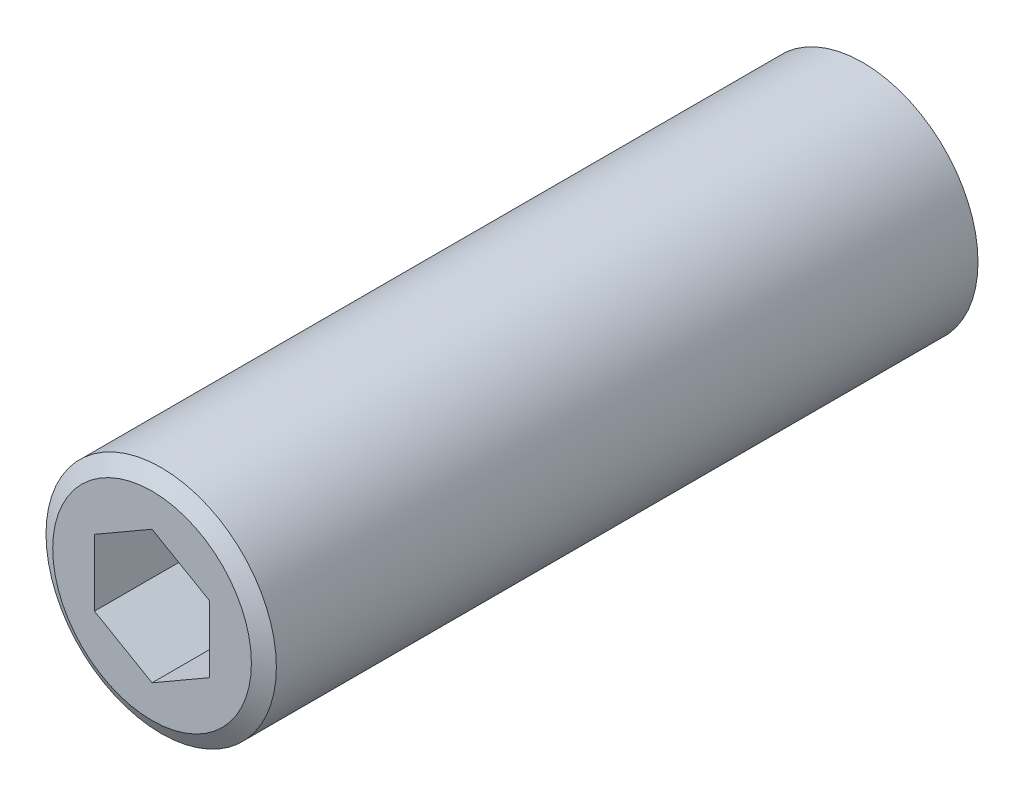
ISO-10303-21;
HEADER;
FILE_DESCRIPTION(('STEP AP214'),'2;1');
FILE_NAME('part.step','',(''),(''),'','','');
FILE_SCHEMA(('AUTOMOTIVE_DESIGN { 1 0 10303 214 1 1 1 1 }'));
ENDSEC;
DATA;
#1=APPLICATION_CONTEXT('core data for automotive mechanical design processes');
#2=APPLICATION_PROTOCOL_DEFINITION('international standard','automotive_design',2000,#1);
#3=PRODUCT_CONTEXT('',#1,'mechanical');
#4=PRODUCT('Part','Part','',(#3));
#5=PRODUCT_RELATED_PRODUCT_CATEGORY('part','',(#4));
#6=PRODUCT_DEFINITION_FORMATION('','',#4);
#7=PRODUCT_DEFINITION_CONTEXT('part definition',#1,'design');
#8=PRODUCT_DEFINITION('design','',#6,#7);
#9=PRODUCT_DEFINITION_SHAPE('','',#8);
#10=(LENGTH_UNIT() NAMED_UNIT(*) SI_UNIT(.MILLI.,.METRE.));
#11=(NAMED_UNIT(*) PLANE_ANGLE_UNIT() SI_UNIT($,.RADIAN.));
#12=(NAMED_UNIT(*) SI_UNIT($,.STERADIAN.) SOLID_ANGLE_UNIT());
#13=UNCERTAINTY_MEASURE_WITH_UNIT(LENGTH_MEASURE(1.E-05),#10,'distance_accuracy_value','');
#14=(GEOMETRIC_REPRESENTATION_CONTEXT(3) GLOBAL_UNCERTAINTY_ASSIGNED_CONTEXT((#13)) GLOBAL_UNIT_ASSIGNED_CONTEXT((#10,
#11,#12)) REPRESENTATION_CONTEXT('',''));
#15=CARTESIAN_POINT('',(0.,0.,0.));
#16=DIRECTION('',(0.,0.,1.));
#17=DIRECTION('',(1.,0.,0.));
#18=AXIS2_PLACEMENT_3D('',#15,#16,#17);
#19=CARTESIAN_POINT('',(1.5,-5.55,0.));
#20=DIRECTION('',(-0.707106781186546,0.,0.707106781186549));
#21=DIRECTION('',(0.707106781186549,0.,0.707106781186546));
#22=AXIS2_PLACEMENT_3D('',#19,#20,#21);
#23=PLANE('',#22);
#24=CARTESIAN_POINT('',(0.,0.,-1.5));
#25=DIRECTION('',(-0.707106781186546,0.,0.707106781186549));
#26=DIRECTION('',(-0.707106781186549,0.,-0.707106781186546));
#27=AXIS2_PLACEMENT_3D('',#24,#25,#26);
#28=ELLIPSE('',#27,7.84888527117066,5.55);
#29=CARTESIAN_POINT('',(3.,4.66931472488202,1.5));
#30=VERTEX_POINT('',#29);
#31=CARTESIAN_POINT('',(2.77,4.80932427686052,1.27));
#32=VERTEX_POINT('',#31);
#33=EDGE_CURVE('E462',#30,#32,#28,.T.);
#34=ORIENTED_EDGE('',*,*,#33,.F.);
#35=DIRECTION('',(0.,1.,0.));
#36=VECTOR('',#35,1.);
#37=CARTESIAN_POINT('',(3.,-5.55,1.5));
#38=LINE('',#37,#36);
#39=CARTESIAN_POINT('',(3.,3.01132144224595,1.5));
#40=VERTEX_POINT('',#39);
#41=EDGE_CURVE('E679',#40,#30,#38,.T.);
#42=ORIENTED_EDGE('',*,*,#41,.F.);
#43=DIRECTION('',(-0.577350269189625,0.577350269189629,-0.577350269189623));
#44=VECTOR('',#43,1.);
#45=CARTESIAN_POINT('',(4.853773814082,1.15754762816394,3.353773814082));
#46=LINE('',#45,#44);
#47=CARTESIAN_POINT('',(1.51132144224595,4.5,0.0113214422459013));
#48=VERTEX_POINT('',#47);
#49=EDGE_CURVE('E520',#40,#48,#46,.T.);
#50=ORIENTED_EDGE('',*,*,#49,.T.);
#51=DIRECTION('',(0.57735026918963,0.57735026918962,0.577350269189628));
#52=VECTOR('',#51,1.);
#53=CARTESIAN_POINT('',(-1.846226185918,1.1424523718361,-3.34622618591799));
#54=LINE('',#53,#52);
#55=CARTESIAN_POINT('',(2.13446219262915,5.12314075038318,0.634462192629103));
#56=VERTEX_POINT('',#55);
#57=EDGE_CURVE('E676',#48,#56,#54,.T.);
#58=ORIENTED_EDGE('',*,*,#57,.T.);
#59=CARTESIAN_POINT('',(0.,0.,-1.5));
#60=DIRECTION('',(-0.707106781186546,0.,0.707106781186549));
#61=DIRECTION('',(0.707106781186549,0.,0.707106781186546));
#62=AXIS2_PLACEMENT_3D('',#59,#60,#61);
#63=ELLIPSE('',#62,7.84888527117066,5.55);
#64=EDGE_CURVE('E723',#32,#56,#63,.T.);
#65=ORIENTED_EDGE('',*,*,#64,.F.);
#66=EDGE_LOOP('',(#34,#42,#50,#58,#65));
#67=FACE_BOUND('',#66,.T.);
#68=ADVANCED_FACE('F14',(#67),#23,.F.);
#69=CARTESIAN_POINT('',(1.5,-5.55,0.));
#70=DIRECTION('',(0.707106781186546,0.,0.707106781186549));
#71=DIRECTION('',(0.707106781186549,0.,-0.707106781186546));
#72=AXIS2_PLACEMENT_3D('',#69,#70,#71);
#73=PLANE('',#72);
#74=CARTESIAN_POINT('',(0.,0.,1.5));
#75=DIRECTION('',(0.707106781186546,0.,0.707106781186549));
#76=DIRECTION('',(0.707106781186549,0.,-0.707106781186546));
#77=AXIS2_PLACEMENT_3D('',#74,#75,#76);
#78=ELLIPSE('',#77,7.84888527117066,5.55);
#79=CARTESIAN_POINT('',(0.22999999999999,5.54523218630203,1.27));
#80=VERTEX_POINT('',#79);
#81=CARTESIAN_POINT('',(0.,5.55,1.5));
#82=VERTEX_POINT('',#81);
#83=EDGE_CURVE('E469',#80,#82,#78,.T.);
#84=ORIENTED_EDGE('',*,*,#83,.F.);
#85=CARTESIAN_POINT('',(0.,0.,1.5));
#86=DIRECTION('',(0.707106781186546,0.,0.707106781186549));
#87=DIRECTION('',(-0.707106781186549,0.,0.707106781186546));
#88=AXIS2_PLACEMENT_3D('',#85,#86,#87);
#89=ELLIPSE('',#88,7.84888527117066,5.55);
#90=CARTESIAN_POINT('',(0.457573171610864,5.53110538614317,1.04242682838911));
#91=VERTEX_POINT('',#90);
#92=EDGE_CURVE('E716',#91,#80,#89,.T.);
#93=ORIENTED_EDGE('',*,*,#92,.F.);
#94=DIRECTION('',(0.57735026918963,-0.57735026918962,-0.577350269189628));
#95=VECTOR('',#94,1.);
#96=CARTESIAN_POINT('',(4.84622618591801,1.1424523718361,-3.34622618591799));
#97=LINE('',#96,#95);
#98=CARTESIAN_POINT('',(1.48867855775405,4.5,0.0113214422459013));
#99=VERTEX_POINT('',#98);
#100=EDGE_CURVE('E670',#91,#99,#97,.T.);
#101=ORIENTED_EDGE('',*,*,#100,.T.);
#102=DIRECTION('',(-0.577350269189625,-0.577350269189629,0.577350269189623));
#103=VECTOR('',#102,1.);
#104=CARTESIAN_POINT('',(-1.853773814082,1.15754762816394,3.353773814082));
#105=LINE('',#104,#103);
#106=CARTESIAN_POINT('',(0.,3.01132144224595,1.5));
#107=VERTEX_POINT('',#106);
#108=EDGE_CURVE('E538',#99,#107,#105,.T.);
#109=ORIENTED_EDGE('',*,*,#108,.T.);
#110=DIRECTION('',(0.,1.,0.));
#111=VECTOR('',#110,1.);
#112=CARTESIAN_POINT('',(0.,-5.55,1.5));
#113=LINE('',#112,#111);
#114=EDGE_CURVE('E685',#107,#82,#113,.T.);
#115=ORIENTED_EDGE('',*,*,#114,.T.);
#116=EDGE_LOOP('',(#84,#93,#101,#109,#115));
#117=FACE_BOUND('',#116,.T.);
#118=ADVANCED_FACE('F778',(#117),#73,.F.);
#119=CARTESIAN_POINT('',(-1.5,-5.55,0.));
#120=DIRECTION('',(-0.707106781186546,0.,0.707106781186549));
#121=DIRECTION('',(0.707106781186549,0.,0.707106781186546));
#122=AXIS2_PLACEMENT_3D('',#119,#120,#121);
#123=PLANE('',#122);
#124=CARTESIAN_POINT('',(0.,0.,1.5));
#125=DIRECTION('',(-0.707106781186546,0.,0.707106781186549));
#126=DIRECTION('',(-0.707106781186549,0.,-0.707106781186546));
#127=AXIS2_PLACEMENT_3D('',#124,#125,#126);
#128=ELLIPSE('',#127,7.84888527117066,5.55);
#129=CARTESIAN_POINT('',(-0.229999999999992,5.54523218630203,1.27));
#130=VERTEX_POINT('',#129);
#131=EDGE_CURVE('E456',#82,#130,#128,.T.);
#132=ORIENTED_EDGE('',*,*,#131,.F.);
#133=ORIENTED_EDGE('',*,*,#114,.F.);
#134=DIRECTION('',(-0.577350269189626,0.577350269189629,-0.577350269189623));
#135=VECTOR('',#134,1.);
#136=CARTESIAN_POINT('',(1.853773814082,1.15754762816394,3.353773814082));
#137=LINE('',#136,#135);
#138=CARTESIAN_POINT('',(-1.48867855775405,4.5,0.0113214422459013));
#139=VERTEX_POINT('',#138);
#140=EDGE_CURVE('E535',#107,#139,#137,.T.);
#141=ORIENTED_EDGE('',*,*,#140,.T.);
#142=DIRECTION('',(0.57735026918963,0.57735026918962,0.577350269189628));
#143=VECTOR('',#142,1.);
#144=CARTESIAN_POINT('',(-4.84622618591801,1.1424523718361,-3.34622618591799));
#145=LINE('',#144,#143);
#146=CARTESIAN_POINT('',(-0.457573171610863,5.53110538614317,1.04242682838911));
#147=VERTEX_POINT('',#146);
#148=EDGE_CURVE('E667',#139,#147,#145,.T.);
#149=ORIENTED_EDGE('',*,*,#148,.T.);
#150=CARTESIAN_POINT('',(0.,0.,1.5));
#151=DIRECTION('',(-0.707106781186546,0.,0.707106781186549));
#152=DIRECTION('',(0.707106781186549,0.,0.707106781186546));
#153=AXIS2_PLACEMENT_3D('',#150,#151,#152);
#154=ELLIPSE('',#153,7.84888527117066,5.55);
#155=EDGE_CURVE('E715',#130,#147,#154,.T.);
#156=ORIENTED_EDGE('',*,*,#155,.F.);
#157=EDGE_LOOP('',(#132,#133,#141,#149,#156));
#158=FACE_BOUND('',#157,.T.);
#159=ADVANCED_FACE('F786',(#158),#123,.F.);
#160=CARTESIAN_POINT('',(-3.,-5.55,1.5));
#161=DIRECTION('',(0.707106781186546,0.,0.707106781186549));
#162=DIRECTION('',(0.707106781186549,0.,-0.707106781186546));
#163=AXIS2_PLACEMENT_3D('',#160,#161,#162);
#164=PLANE('',#163);
#165=CARTESIAN_POINT('',(0.,0.,-1.5));
#166=DIRECTION('',(0.707106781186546,0.,0.707106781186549));
#167=DIRECTION('',(0.707106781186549,0.,-0.707106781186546));
#168=AXIS2_PLACEMENT_3D('',#165,#166,#167);
#169=ELLIPSE('',#168,7.84888527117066,5.55);
#170=CARTESIAN_POINT('',(-2.77,4.80932427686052,1.27));
#171=VERTEX_POINT('',#170);
#172=CARTESIAN_POINT('',(-3.,4.66931472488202,1.5));
#173=VERTEX_POINT('',#172);
#174=EDGE_CURVE('E466',#171,#173,#169,.T.);
#175=ORIENTED_EDGE('',*,*,#174,.F.);
#176=CARTESIAN_POINT('',(0.,0.,-1.5));
#177=DIRECTION('',(0.707106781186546,0.,0.707106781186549));
#178=DIRECTION('',(-0.707106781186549,0.,0.707106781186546));
#179=AXIS2_PLACEMENT_3D('',#176,#177,#178);
#180=ELLIPSE('',#179,7.84888527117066,5.55);
#181=CARTESIAN_POINT('',(-2.13446219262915,5.12314075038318,0.634462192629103));
#182=VERTEX_POINT('',#181);
#183=EDGE_CURVE('E708',#182,#171,#180,.T.);
#184=ORIENTED_EDGE('',*,*,#183,.F.);
#185=DIRECTION('',(0.57735026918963,-0.57735026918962,-0.577350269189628));
#186=VECTOR('',#185,1.);
#187=CARTESIAN_POINT('',(0.846226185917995,2.14245237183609,-2.34622618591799));
#188=LINE('',#187,#186);
#189=CARTESIAN_POINT('',(-1.51132144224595,4.5,0.0113214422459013));
#190=VERTEX_POINT('',#189);
#191=EDGE_CURVE('E752',#182,#190,#188,.T.);
#192=ORIENTED_EDGE('',*,*,#191,.T.);
#193=DIRECTION('',(-0.577350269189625,-0.577350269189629,0.577350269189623));
#194=VECTOR('',#193,1.);
#195=CARTESIAN_POINT('',(-5.853773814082,0.157547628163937,4.353773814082));
#196=LINE('',#195,#194);
#197=CARTESIAN_POINT('',(-3.,3.01132144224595,1.5));
#198=VERTEX_POINT('',#197);
#199=EDGE_CURVE('E529',#190,#198,#196,.T.);
#200=ORIENTED_EDGE('',*,*,#199,.T.);
#201=DIRECTION('',(0.,1.,0.));
#202=VECTOR('',#201,1.);
#203=CARTESIAN_POINT('',(-3.,-5.55,1.5));
#204=LINE('',#203,#202);
#205=EDGE_CURVE('E689',#198,#173,#204,.T.);
#206=ORIENTED_EDGE('',*,*,#205,.T.);
#207=EDGE_LOOP('',(#175,#184,#192,#200,#206));
#208=FACE_BOUND('',#207,.T.);
#209=ADVANCED_FACE('F1037',(#208),#164,.F.);
#210=CARTESIAN_POINT('',(-4.5,-5.55,0.));
#211=DIRECTION('',(-0.707106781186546,0.,0.707106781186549));
#212=DIRECTION('',(0.707106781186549,0.,0.707106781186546));
#213=AXIS2_PLACEMENT_3D('',#210,#211,#212);
#214=PLANE('',#213);
#215=CARTESIAN_POINT('',(0.,0.,4.5));
#216=DIRECTION('',(-0.707106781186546,0.,0.707106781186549));
#217=DIRECTION('',(-0.707106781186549,0.,-0.707106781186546));
#218=AXIS2_PLACEMENT_3D('',#215,#216,#217);
#219=ELLIPSE('',#218,7.84888527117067,5.55);
#220=CARTESIAN_POINT('',(-3.23,4.51326932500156,1.27));
#221=VERTEX_POINT('',#220);
#222=EDGE_CURVE('E37',#173,#221,#219,.T.);
#223=ORIENTED_EDGE('',*,*,#222,.F.);
#224=ORIENTED_EDGE('',*,*,#205,.F.);
#225=DIRECTION('',(-0.577350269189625,0.577350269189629,-0.577350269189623));
#226=VECTOR('',#225,1.);
#227=CARTESIAN_POINT('',(-1.146226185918,1.15754762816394,3.353773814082));
#228=LINE('',#227,#226);
#229=CARTESIAN_POINT('',(-3.91877783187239,3.93009927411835,0.581222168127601));
#230=VERTEX_POINT('',#229);
#231=EDGE_CURVE('E526',#198,#230,#228,.T.);
#232=ORIENTED_EDGE('',*,*,#231,.T.);
#233=CARTESIAN_POINT('',(0.,0.,4.5));
#234=DIRECTION('',(-0.707106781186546,0.,0.707106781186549));
#235=DIRECTION('',(0.707106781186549,0.,0.707106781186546));
#236=AXIS2_PLACEMENT_3D('',#233,#234,#235);
#237=ELLIPSE('',#236,7.84888527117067,5.55);
#238=EDGE_CURVE('E707',#221,#230,#237,.T.);
#239=ORIENTED_EDGE('',*,*,#238,.F.);
#240=EDGE_LOOP('',(#223,#224,#232,#239));
#241=FACE_BOUND('',#240,.T.);
#242=ADVANCED_FACE('F819',(#241),#214,.F.);
#243=CARTESIAN_POINT('',(3.,-5.55,1.5));
#244=DIRECTION('',(0.707106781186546,0.,0.707106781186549));
#245=DIRECTION('',(0.707106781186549,0.,-0.707106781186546));
#246=AXIS2_PLACEMENT_3D('',#243,#244,#245);
#247=PLANE('',#246);
#248=CARTESIAN_POINT('',(0.,0.,4.5));
#249=DIRECTION('',(0.707106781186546,0.,0.707106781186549));
#250=DIRECTION('',(0.707106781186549,0.,-0.707106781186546));
#251=AXIS2_PLACEMENT_3D('',#248,#249,#250);
#252=ELLIPSE('',#251,7.84888527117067,5.55);
#253=CARTESIAN_POINT('',(3.23,4.51326932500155,1.27));
#254=VERTEX_POINT('',#253);
#255=EDGE_CURVE('E459',#254,#30,#252,.T.);
#256=ORIENTED_EDGE('',*,*,#255,.F.);
#257=CARTESIAN_POINT('',(0.,0.,4.5));
#258=DIRECTION('',(0.707106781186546,0.,0.707106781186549));
#259=DIRECTION('',(-0.707106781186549,0.,0.707106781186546));
#260=AXIS2_PLACEMENT_3D('',#257,#258,#259);
#261=ELLIPSE('',#260,7.84888527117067,5.55);
#262=CARTESIAN_POINT('',(3.91877783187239,3.93009927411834,0.581222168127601));
#263=VERTEX_POINT('',#262);
#264=EDGE_CURVE('E683',#263,#254,#261,.T.);
#265=ORIENTED_EDGE('',*,*,#264,.F.);
#266=DIRECTION('',(-0.577350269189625,-0.577350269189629,0.577350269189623));
#267=VECTOR('',#266,1.);
#268=CARTESIAN_POINT('',(0.146226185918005,0.157547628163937,4.353773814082));
#269=LINE('',#268,#267);
#270=EDGE_CURVE('E734',#263,#40,#269,.T.);
#271=ORIENTED_EDGE('',*,*,#270,.T.);
#272=ORIENTED_EDGE('',*,*,#41,.T.);
#273=EDGE_LOOP('',(#256,#265,#271,#272));
#274=FACE_BOUND('',#273,.T.);
#275=ADVANCED_FACE('F794',(#274),#247,.F.);
#276=CARTESIAN_POINT('',(0.,0.,-1.5));
#277=DIRECTION('',(-0.707106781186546,0.,0.707106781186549));
#278=DIRECTION('',(-0.707106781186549,0.,-0.707106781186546));
#279=AXIS2_PLACEMENT_3D('',#276,#277,#278);
#280=ELLIPSE('',#279,7.84888527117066,5.55);
#281=CARTESIAN_POINT('',(2.77,-4.80932427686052,1.27));
#282=VERTEX_POINT('',#281);
#283=CARTESIAN_POINT('',(3.,-4.66931472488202,1.5));
#284=VERTEX_POINT('',#283);
#285=EDGE_CURVE('E442',#282,#284,#280,.T.);
#286=ORIENTED_EDGE('',*,*,#285,.F.);
#287=CARTESIAN_POINT('',(2.13446219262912,-5.12314075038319,0.634462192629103));
#288=VERTEX_POINT('',#287);
#289=EDGE_CURVE('E720',#288,#282,#63,.T.);
#290=ORIENTED_EDGE('',*,*,#289,.F.);
#291=DIRECTION('',(-0.577350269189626,0.577350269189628,-0.577350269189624));
#292=VECTOR('',#291,1.);
#293=CARTESIAN_POINT('',(1.85377381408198,-4.84245237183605,0.353773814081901));
#294=LINE('',#293,#292);
#295=CARTESIAN_POINT('',(1.51132144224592,-4.5,0.0113214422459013));
#296=VERTEX_POINT('',#295);
#297=EDGE_CURVE('E661',#288,#296,#294,.T.);
#298=ORIENTED_EDGE('',*,*,#297,.T.);
#299=DIRECTION('',(0.577350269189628,0.577350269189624,0.577350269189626));
#300=VECTOR('',#299,1.);
#301=CARTESIAN_POINT('',(1.15377381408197,-4.85754762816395,-0.346226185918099));
#302=LINE('',#301,#300);
#303=CARTESIAN_POINT('',(3.,-3.01132144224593,1.5));
#304=VERTEX_POINT('',#303);
#305=EDGE_CURVE('E499',#296,#304,#302,.T.);
#306=ORIENTED_EDGE('',*,*,#305,.T.);
#307=EDGE_CURVE('E690',#284,#304,#38,.T.);
#308=ORIENTED_EDGE('',*,*,#307,.F.);
#309=EDGE_LOOP('',(#286,#290,#298,#306,#308));
#310=FACE_BOUND('',#309,.T.);
#311=ADVANCED_FACE('F781',(#310),#23,.F.);
#312=CARTESIAN_POINT('',(0.,0.,1.5));
#313=DIRECTION('',(0.707106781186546,0.,0.707106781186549));
#314=DIRECTION('',(0.707106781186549,0.,-0.707106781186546));
#315=AXIS2_PLACEMENT_3D('',#312,#313,#314);
#316=ELLIPSE('',#315,7.84888527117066,5.55);
#317=CARTESIAN_POINT('',(0.,-5.55,1.5));
#318=VERTEX_POINT('',#317);
#319=CARTESIAN_POINT('',(0.22999999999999,-5.54523218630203,1.27));
#320=VERTEX_POINT('',#319);
#321=EDGE_CURVE('E453',#318,#320,#316,.T.);
#322=ORIENTED_EDGE('',*,*,#321,.F.);
#323=CARTESIAN_POINT('',(0.,-3.01132144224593,1.5));
#324=VERTEX_POINT('',#323);
#325=EDGE_CURVE('E680',#318,#324,#113,.T.);
#326=ORIENTED_EDGE('',*,*,#325,.T.);
#327=DIRECTION('',(0.577350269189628,-0.577350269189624,-0.577350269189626));
#328=VECTOR('',#327,1.);
#329=CARTESIAN_POINT('',(1.84622618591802,-4.85754762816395,-0.346226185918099));
#330=LINE('',#329,#328);
#331=CARTESIAN_POINT('',(1.48867855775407,-4.5,0.0113214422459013));
#332=VERTEX_POINT('',#331);
#333=EDGE_CURVE('E517',#324,#332,#330,.T.);
#334=ORIENTED_EDGE('',*,*,#333,.T.);
#335=DIRECTION('',(-0.577350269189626,-0.577350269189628,0.577350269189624));
#336=VECTOR('',#335,1.);
#337=CARTESIAN_POINT('',(1.14622618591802,-4.84245237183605,0.353773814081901));
#338=LINE('',#337,#336);
#339=CARTESIAN_POINT('',(0.457573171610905,-5.53110538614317,1.04242682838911));
#340=VERTEX_POINT('',#339);
#341=EDGE_CURVE('E655',#332,#340,#338,.T.);
#342=ORIENTED_EDGE('',*,*,#341,.T.);
#343=EDGE_CURVE('E719',#320,#340,#89,.T.);
#344=ORIENTED_EDGE('',*,*,#343,.F.);
#345=EDGE_LOOP('',(#322,#326,#334,#342,#344));
#346=FACE_BOUND('',#345,.T.);
#347=ADVANCED_FACE('F789',(#346),#73,.F.);
#348=CARTESIAN_POINT('',(0.,0.,1.5));
#349=DIRECTION('',(-0.707106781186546,0.,0.707106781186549));
#350=DIRECTION('',(-0.707106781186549,0.,-0.707106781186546));
#351=AXIS2_PLACEMENT_3D('',#348,#349,#350);
#352=ELLIPSE('',#351,7.84888527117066,5.55);
#353=CARTESIAN_POINT('',(-0.229999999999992,-5.54523218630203,1.27));
#354=VERTEX_POINT('',#353);
#355=EDGE_CURVE('E450',#354,#318,#352,.T.);
#356=ORIENTED_EDGE('',*,*,#355,.F.);
#357=CARTESIAN_POINT('',(-0.457573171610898,-5.53110538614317,1.04242682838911));
#358=VERTEX_POINT('',#357);
#359=EDGE_CURVE('E712',#358,#354,#154,.T.);
#360=ORIENTED_EDGE('',*,*,#359,.F.);
#361=DIRECTION('',(-0.577350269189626,0.577350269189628,-0.577350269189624));
#362=VECTOR('',#361,1.);
#363=CARTESIAN_POINT('',(-1.14622618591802,-4.84245237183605,0.353773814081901));
#364=LINE('',#363,#362);
#365=CARTESIAN_POINT('',(-1.48867855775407,-4.5,0.0113214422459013));
#366=VERTEX_POINT('',#365);
#367=EDGE_CURVE('E652',#358,#366,#364,.T.);
#368=ORIENTED_EDGE('',*,*,#367,.T.);
#369=DIRECTION('',(0.577350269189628,0.577350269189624,0.577350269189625));
#370=VECTOR('',#369,1.);
#371=CARTESIAN_POINT('',(-1.84622618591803,-4.85754762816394,-0.346226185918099));
#372=LINE('',#371,#370);
#373=EDGE_CURVE('E514',#366,#324,#372,.T.);
#374=ORIENTED_EDGE('',*,*,#373,.T.);
#375=ORIENTED_EDGE('',*,*,#325,.F.);
#376=EDGE_LOOP('',(#356,#360,#368,#374,#375));
#377=FACE_BOUND('',#376,.T.);
#378=ADVANCED_FACE('F1074',(#377),#123,.F.);
#379=CARTESIAN_POINT('',(0.,0.,-1.5));
#380=DIRECTION('',(0.707106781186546,0.,0.707106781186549));
#381=DIRECTION('',(0.707106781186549,0.,-0.707106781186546));
#382=AXIS2_PLACEMENT_3D('',#379,#380,#381);
#383=ELLIPSE('',#382,7.84888527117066,5.55);
#384=CARTESIAN_POINT('',(-3.,-4.66931472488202,1.5));
#385=VERTEX_POINT('',#384);
#386=CARTESIAN_POINT('',(-2.77,-4.80932427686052,1.27));
#387=VERTEX_POINT('',#386);
#388=EDGE_CURVE('E447',#385,#387,#383,.T.);
#389=ORIENTED_EDGE('',*,*,#388,.F.);
#390=CARTESIAN_POINT('',(-3.,-3.01132144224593,1.5));
#391=VERTEX_POINT('',#390);
#392=EDGE_CURVE('E686',#385,#391,#204,.T.);
#393=ORIENTED_EDGE('',*,*,#392,.T.);
#394=DIRECTION('',(0.577350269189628,-0.577350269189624,-0.577350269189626));
#395=VECTOR('',#394,1.);
#396=CARTESIAN_POINT('',(-2.15377381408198,-3.85754762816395,0.653773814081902));
#397=LINE('',#396,#395);
#398=CARTESIAN_POINT('',(-1.51132144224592,-4.5,0.0113214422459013));
#399=VERTEX_POINT('',#398);
#400=EDGE_CURVE('E508',#391,#399,#397,.T.);
#401=ORIENTED_EDGE('',*,*,#400,.T.);
#402=DIRECTION('',(-0.577350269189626,-0.577350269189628,0.577350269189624));
#403=VECTOR('',#402,1.);
#404=CARTESIAN_POINT('',(-2.85377381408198,-5.84245237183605,1.3537738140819));
#405=LINE('',#404,#403);
#406=CARTESIAN_POINT('',(-2.13446219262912,-5.12314075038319,0.634462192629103));
#407=VERTEX_POINT('',#406);
#408=EDGE_CURVE('E749',#399,#407,#405,.T.);
#409=ORIENTED_EDGE('',*,*,#408,.T.);
#410=EDGE_CURVE('E711',#387,#407,#180,.T.);
#411=ORIENTED_EDGE('',*,*,#410,.F.);
#412=EDGE_LOOP('',(#389,#393,#401,#409,#411));
#413=FACE_BOUND('',#412,.T.);
#414=ADVANCED_FACE('F1097',(#413),#164,.F.);
#415=CARTESIAN_POINT('',(0.,0.,4.5));
#416=DIRECTION('',(-0.707106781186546,0.,0.707106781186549));
#417=DIRECTION('',(-0.707106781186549,0.,-0.707106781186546));
#418=AXIS2_PLACEMENT_3D('',#415,#416,#417);
#419=ELLIPSE('',#418,7.84888527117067,5.55);
#420=CARTESIAN_POINT('',(-3.23,-4.51326932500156,1.27));
#421=VERTEX_POINT('',#420);
#422=EDGE_CURVE('E444',#421,#385,#419,.T.);
#423=ORIENTED_EDGE('',*,*,#422,.F.);
#424=CARTESIAN_POINT('',(-3.91877783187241,-3.93009927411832,0.581222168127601));
#425=VERTEX_POINT('',#424);
#426=EDGE_CURVE('E704',#425,#421,#237,.T.);
#427=ORIENTED_EDGE('',*,*,#426,.F.);
#428=DIRECTION('',(0.577350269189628,0.577350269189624,0.577350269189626));
#429=VECTOR('',#428,1.);
#430=CARTESIAN_POINT('',(-4.84622618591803,-4.85754762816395,-0.346226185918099));
#431=LINE('',#430,#429);
#432=EDGE_CURVE('E505',#425,#391,#431,.T.);
#433=ORIENTED_EDGE('',*,*,#432,.T.);
#434=ORIENTED_EDGE('',*,*,#392,.F.);
#435=EDGE_LOOP('',(#423,#427,#433,#434));
#436=FACE_BOUND('',#435,.T.);
#437=ADVANCED_FACE('F1065',(#436),#214,.F.);
#438=CARTESIAN_POINT('',(0.,0.,4.5));
#439=DIRECTION('',(0.707106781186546,0.,0.707106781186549));
#440=DIRECTION('',(0.707106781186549,0.,-0.707106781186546));
#441=AXIS2_PLACEMENT_3D('',#438,#439,#440);
#442=ELLIPSE('',#441,7.84888527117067,5.55);
#443=CARTESIAN_POINT('',(3.23,-4.51326932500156,1.27));
#444=VERTEX_POINT('',#443);
#445=EDGE_CURVE('E440',#284,#444,#442,.T.);
#446=ORIENTED_EDGE('',*,*,#445,.F.);
#447=ORIENTED_EDGE('',*,*,#307,.T.);
#448=DIRECTION('',(0.577350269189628,-0.577350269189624,-0.577350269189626));
#449=VECTOR('',#448,1.);
#450=CARTESIAN_POINT('',(3.84622618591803,-3.85754762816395,0.653773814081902));
#451=LINE('',#450,#449);
#452=CARTESIAN_POINT('',(3.9187778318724,-3.93009927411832,0.581222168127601));
#453=VERTEX_POINT('',#452);
#454=EDGE_CURVE('E731',#304,#453,#451,.T.);
#455=ORIENTED_EDGE('',*,*,#454,.T.);
#456=EDGE_CURVE('E695',#444,#453,#261,.T.);
#457=ORIENTED_EDGE('',*,*,#456,.F.);
#458=EDGE_LOOP('',(#446,#447,#455,#457));
#459=FACE_BOUND('',#458,.T.);
#460=ADVANCED_FACE('F806',(#459),#247,.F.);
#461=CARTESIAN_POINT('',(-5.55,-1.5,0.0113214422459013));
#462=DIRECTION('',(0.,0.707106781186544,0.707106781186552));
#463=DIRECTION('',(0.,0.707106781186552,-0.707106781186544));
#464=AXIS2_PLACEMENT_3D('',#461,#462,#463);
#465=PLANE('',#464);
#466=CARTESIAN_POINT('',(0.,0.,-1.4886785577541));
#467=DIRECTION('',(0.,0.707106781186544,0.707106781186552));
#468=DIRECTION('',(0.,0.707106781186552,-0.707106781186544));
#469=AXIS2_PLACEMENT_3D('',#466,#467,#468);
#470=ELLIPSE('',#469,7.84888527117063,5.55);
#471=CARTESIAN_POINT('',(-4.81582730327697,-2.75867855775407,1.27));
#472=VERTEX_POINT('',#471);
#473=CARTESIAN_POINT('',(-4.66931472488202,-3.,1.5113214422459));
#474=VERTEX_POINT('',#473);
#475=EDGE_CURVE('E420',#472,#474,#470,.T.);
#476=ORIENTED_EDGE('',*,*,#475,.F.);
#477=CARTESIAN_POINT('',(0.,0.,-1.4886785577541));
#478=DIRECTION('',(0.,0.707106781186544,0.707106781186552));
#479=DIRECTION('',(0.,-0.707106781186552,0.707106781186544));
#480=AXIS2_PLACEMENT_3D('',#477,#478,#479);
#481=ELLIPSE('',#480,7.84888527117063,5.55);
#482=CARTESIAN_POINT('',(-5.1297793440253,-2.11845790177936,0.629779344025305));
#483=VERTEX_POINT('',#482);
#484=EDGE_CURVE('E646',#483,#472,#481,.T.);
#485=ORIENTED_EDGE('',*,*,#484,.F.);
#486=DIRECTION('',(-0.577350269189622,-0.577350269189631,0.577350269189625));
#487=VECTOR('',#486,1.);
#488=CARTESIAN_POINT('',(-6.55377381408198,-3.54245237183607,2.053773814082));
#489=LINE('',#488,#487);
#490=CARTESIAN_POINT('',(-4.51132144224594,-1.5,0.0113214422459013));
#491=VERTEX_POINT('',#490);
#492=EDGE_CURVE('E643',#491,#483,#489,.T.);
#493=ORIENTED_EDGE('',*,*,#492,.F.);
#494=DIRECTION('',(1.,0.,0.));
#495=VECTOR('',#494,1.);
#496=CARTESIAN_POINT('',(-5.55,-1.5,0.0113214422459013));
#497=LINE('',#496,#495);
#498=CARTESIAN_POINT('',(-4.48867855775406,-1.5,0.0113214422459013));
#499=VERTEX_POINT('',#498);
#500=EDGE_CURVE('E478',#491,#499,#497,.T.);
#501=ORIENTED_EDGE('',*,*,#500,.T.);
#502=DIRECTION('',(-0.577350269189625,0.57735026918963,-0.577350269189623));
#503=VECTOR('',#502,1.);
#504=CARTESIAN_POINT('',(-3.14622618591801,-2.84245237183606,1.353773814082));
#505=LINE('',#504,#503);
#506=CARTESIAN_POINT('',(-3.,-2.98867855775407,1.5));
#507=VERTEX_POINT('',#506);
#508=EDGE_CURVE('E625',#507,#499,#505,.T.);
#509=ORIENTED_EDGE('',*,*,#508,.F.);
#510=DIRECTION('',(-0.577350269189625,-0.57735026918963,0.577350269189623));
#511=VECTOR('',#510,1.);
#512=CARTESIAN_POINT('',(-3.85377381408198,-3.84245237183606,2.35377381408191));
#513=LINE('',#512,#511);
#514=CARTESIAN_POINT('',(-1.51132144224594,-1.5,0.0113214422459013));
#515=VERTEX_POINT('',#514);
#516=EDGE_CURVE('E628',#515,#507,#513,.T.);
#517=ORIENTED_EDGE('',*,*,#516,.F.);
#518=CARTESIAN_POINT('',(-1.48867855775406,-1.5,0.0113214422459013));
#519=VERTEX_POINT('',#518);
#520=EDGE_CURVE('E924',#515,#519,#497,.T.);
#521=ORIENTED_EDGE('',*,*,#520,.T.);
#522=DIRECTION('',(-0.577350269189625,0.577350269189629,-0.577350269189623));
#523=VECTOR('',#522,1.);
#524=CARTESIAN_POINT('',(-0.146226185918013,-2.84245237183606,1.353773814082));
#525=LINE('',#524,#523);
#526=CARTESIAN_POINT('',(0.,-2.98867855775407,1.5));
#527=VERTEX_POINT('',#526);
#528=EDGE_CURVE('E631',#527,#519,#525,.T.);
#529=ORIENTED_EDGE('',*,*,#528,.F.);
#530=DIRECTION('',(-0.577350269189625,-0.57735026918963,0.577350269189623));
#531=VECTOR('',#530,1.);
#532=CARTESIAN_POINT('',(0.146226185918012,-2.84245237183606,1.353773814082));
#533=LINE('',#532,#531);
#534=CARTESIAN_POINT('',(1.48867855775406,-1.5,0.0113214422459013));
#535=VERTEX_POINT('',#534);
#536=EDGE_CURVE('E634',#535,#527,#533,.T.);
#537=ORIENTED_EDGE('',*,*,#536,.F.);
#538=CARTESIAN_POINT('',(1.51132144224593,-1.5,0.0113214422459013));
#539=VERTEX_POINT('',#538);
#540=EDGE_CURVE('E476',#535,#539,#497,.T.);
#541=ORIENTED_EDGE('',*,*,#540,.T.);
#542=DIRECTION('',(-0.577350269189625,0.57735026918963,-0.577350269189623));
#543=VECTOR('',#542,1.);
#544=CARTESIAN_POINT('',(2.85377381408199,-2.84245237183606,1.353773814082));
#545=LINE('',#544,#543);
#546=CARTESIAN_POINT('',(3.,-2.98867855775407,1.5));
#547=VERTEX_POINT('',#546);
#548=EDGE_CURVE('E622',#547,#539,#545,.T.);
#549=ORIENTED_EDGE('',*,*,#548,.F.);
#550=DIRECTION('',(-0.577350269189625,-0.57735026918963,0.577350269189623));
#551=VECTOR('',#550,1.);
#552=CARTESIAN_POINT('',(2.14622618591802,-3.84245237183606,2.35377381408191));
#553=LINE('',#552,#551);
#554=CARTESIAN_POINT('',(4.48867855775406,-1.5,0.0113214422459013));
#555=VERTEX_POINT('',#554);
#556=EDGE_CURVE('E746',#555,#547,#553,.T.);
#557=ORIENTED_EDGE('',*,*,#556,.F.);
#558=CARTESIAN_POINT('',(4.51132144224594,-1.5,0.0113214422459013));
#559=VERTEX_POINT('',#558);
#560=EDGE_CURVE('E473',#555,#559,#497,.T.);
#561=ORIENTED_EDGE('',*,*,#560,.T.);
#562=DIRECTION('',(-0.577350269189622,0.577350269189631,-0.577350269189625));
#563=VECTOR('',#562,1.);
#564=CARTESIAN_POINT('',(5.85377381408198,-2.84245237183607,1.353773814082));
#565=LINE('',#564,#563);
#566=CARTESIAN_POINT('',(5.12977934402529,-2.11845790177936,0.629779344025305));
#567=VERTEX_POINT('',#566);
#568=EDGE_CURVE('E637',#567,#559,#565,.T.);
#569=ORIENTED_EDGE('',*,*,#568,.F.);
#570=CARTESIAN_POINT('',(0.,0.,-1.4886785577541));
#571=DIRECTION('',(0.,0.707106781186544,0.707106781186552));
#572=DIRECTION('',(0.,-0.707106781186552,0.707106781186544));
#573=AXIS2_PLACEMENT_3D('',#570,#571,#572);
#574=ELLIPSE('',#573,7.84888527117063,5.55);
#575=CARTESIAN_POINT('',(4.81582730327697,-2.75867855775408,1.27));
#576=VERTEX_POINT('',#575);
#577=EDGE_CURVE('E640',#576,#567,#574,.T.);
#578=ORIENTED_EDGE('',*,*,#577,.F.);
#579=CARTESIAN_POINT('',(4.66931472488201,-3.,1.5113214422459));
#580=VERTEX_POINT('',#579);
#581=EDGE_CURVE('E423',#580,#576,#470,.T.);
#582=ORIENTED_EDGE('',*,*,#581,.F.);
#583=DIRECTION('',(1.,0.,0.));
#584=VECTOR('',#583,1.);
#585=CARTESIAN_POINT('',(-5.55,-3.,1.5113214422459));
#586=LINE('',#585,#584);
#587=EDGE_CURVE('E472',#474,#580,#586,.T.);
#588=ORIENTED_EDGE('',*,*,#587,.F.);
#589=EDGE_LOOP('',(#476,#485,#493,#501,#509,#517,#521,#529,#537,#541,#549,#557,#561,#569,#578,
#582,#588));
#590=FACE_BOUND('',#589,.T.);
#591=ADVANCED_FACE('F874',(#590),#465,.F.);
#592=CARTESIAN_POINT('',(-5.55,-1.5,0.0113214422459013));
#593=DIRECTION('',(0.,-0.707106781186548,0.707106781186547));
#594=DIRECTION('',(0.,0.707106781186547,0.707106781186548));
#595=AXIS2_PLACEMENT_3D('',#592,#593,#594);
#596=PLANE('',#595);
#597=CARTESIAN_POINT('',(0.,0.,1.5113214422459));
#598=DIRECTION('',(0.,-0.707106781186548,0.707106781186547));
#599=DIRECTION('',(0.,-0.707106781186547,-0.707106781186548));
#600=AXIS2_PLACEMENT_3D('',#597,#598,#599);
#601=ELLIPSE('',#600,7.84888527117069,5.55);
#602=CARTESIAN_POINT('',(5.5447510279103,-0.241321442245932,1.27));
#603=VERTEX_POINT('',#602);
#604=CARTESIAN_POINT('',(5.55,0.,1.5113214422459));
#605=VERTEX_POINT('',#604);
#606=EDGE_CURVE('E435',#603,#605,#601,.T.);
#607=ORIENTED_EDGE('',*,*,#606,.F.);
#608=CARTESIAN_POINT('',(0.,0.,1.5113214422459));
#609=DIRECTION('',(0.,-0.707106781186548,0.707106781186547));
#610=DIRECTION('',(0.,0.707106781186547,0.707106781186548));
#611=AXIS2_PLACEMENT_3D('',#608,#609,#610);
#612=ELLIPSE('',#611,7.84888527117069,5.55);
#613=CARTESIAN_POINT('',(5.52900247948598,-0.482318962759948,1.029002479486));
#614=VERTEX_POINT('',#613);
#615=EDGE_CURVE('E613',#614,#603,#612,.T.);
#616=ORIENTED_EDGE('',*,*,#615,.F.);
#617=DIRECTION('',(0.577350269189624,0.577350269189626,0.577350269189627));
#618=VECTOR('',#617,1.);
#619=CARTESIAN_POINT('',(3.15377381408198,-2.85754762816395,-1.3462261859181));
#620=LINE('',#619,#618);
#621=EDGE_CURVE('E610',#559,#614,#620,.T.);
#622=ORIENTED_EDGE('',*,*,#621,.F.);
#623=ORIENTED_EDGE('',*,*,#560,.F.);
#624=DIRECTION('',(0.577350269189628,-0.577350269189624,-0.577350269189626));
#625=VECTOR('',#624,1.);
#626=CARTESIAN_POINT('',(4.84622618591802,-1.85754762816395,-0.346226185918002));
#627=LINE('',#626,#625);
#628=CARTESIAN_POINT('',(3.,-0.0113214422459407,1.5));
#629=VERTEX_POINT('',#628);
#630=EDGE_CURVE('E743',#629,#555,#627,.T.);
#631=ORIENTED_EDGE('',*,*,#630,.F.);
#632=DIRECTION('',(0.577350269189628,0.577350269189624,0.577350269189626));
#633=VECTOR('',#632,1.);
#634=CARTESIAN_POINT('',(0.153773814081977,-2.85754762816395,-1.346226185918));
#635=LINE('',#634,#633);
#636=EDGE_CURVE('E595',#539,#629,#635,.T.);
#637=ORIENTED_EDGE('',*,*,#636,.F.);
#638=ORIENTED_EDGE('',*,*,#540,.F.);
#639=DIRECTION('',(0.577350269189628,-0.577350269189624,-0.577350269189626));
#640=VECTOR('',#639,1.);
#641=CARTESIAN_POINT('',(2.84622618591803,-2.85754762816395,-1.346226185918));
#642=LINE('',#641,#640);
#643=CARTESIAN_POINT('',(0.,-0.0113214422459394,1.5));
#644=VERTEX_POINT('',#643);
#645=EDGE_CURVE('E607',#644,#535,#642,.T.);
#646=ORIENTED_EDGE('',*,*,#645,.F.);
#647=DIRECTION('',(0.577350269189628,0.577350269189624,0.577350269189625));
#648=VECTOR('',#647,1.);
#649=CARTESIAN_POINT('',(-2.84622618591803,-2.85754762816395,-1.346226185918));
#650=LINE('',#649,#648);
#651=EDGE_CURVE('E604',#519,#644,#650,.T.);
#652=ORIENTED_EDGE('',*,*,#651,.F.);
#653=ORIENTED_EDGE('',*,*,#520,.F.);
#654=DIRECTION('',(0.577350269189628,-0.577350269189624,-0.577350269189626));
#655=VECTOR('',#654,1.);
#656=CARTESIAN_POINT('',(-1.15377381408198,-1.85754762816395,-0.346226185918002));
#657=LINE('',#656,#655);
#658=CARTESIAN_POINT('',(-3.,-0.0113214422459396,1.5));
#659=VERTEX_POINT('',#658);
#660=EDGE_CURVE('E601',#659,#515,#657,.T.);
#661=ORIENTED_EDGE('',*,*,#660,.F.);
#662=DIRECTION('',(0.577350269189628,0.577350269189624,0.577350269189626));
#663=VECTOR('',#662,1.);
#664=CARTESIAN_POINT('',(-5.84622618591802,-2.85754762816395,-1.346226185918));
#665=LINE('',#664,#663);
#666=EDGE_CURVE('E598',#499,#659,#665,.T.);
#667=ORIENTED_EDGE('',*,*,#666,.F.);
#668=ORIENTED_EDGE('',*,*,#500,.F.);
#669=DIRECTION('',(0.577350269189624,-0.577350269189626,-0.577350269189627));
#670=VECTOR('',#669,1.);
#671=CARTESIAN_POINT('',(-3.85377381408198,-2.15754762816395,-0.646226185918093));
#672=LINE('',#671,#670);
#673=CARTESIAN_POINT('',(-5.52900247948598,-0.482318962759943,1.029002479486));
#674=VERTEX_POINT('',#673);
#675=EDGE_CURVE('E616',#674,#491,#672,.T.);
#676=ORIENTED_EDGE('',*,*,#675,.F.);
#677=CARTESIAN_POINT('',(0.,0.,1.5113214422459));
#678=DIRECTION('',(0.,-0.707106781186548,0.707106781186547));
#679=DIRECTION('',(0.,0.707106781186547,0.707106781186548));
#680=AXIS2_PLACEMENT_3D('',#677,#678,#679);
#681=ELLIPSE('',#680,7.84888527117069,5.55);
#682=CARTESIAN_POINT('',(-5.5447510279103,-0.241321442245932,1.27));
#683=VERTEX_POINT('',#682);
#684=EDGE_CURVE('E619',#683,#674,#681,.T.);
#685=ORIENTED_EDGE('',*,*,#684,.F.);
#686=CARTESIAN_POINT('',(-5.55,0.,1.5113214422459));
#687=VERTEX_POINT('',#686);
#688=EDGE_CURVE('E439',#687,#683,#601,.T.);
#689=ORIENTED_EDGE('',*,*,#688,.F.);
#690=DIRECTION('',(1.,0.,0.));
#691=VECTOR('',#690,1.);
#692=CARTESIAN_POINT('',(-5.55,0.,1.5113214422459));
#693=LINE('',#692,#691);
#694=EDGE_CURVE('E477',#687,#605,#693,.T.);
#695=ORIENTED_EDGE('',*,*,#694,.T.);
#696=EDGE_LOOP('',(#607,#616,#622,#623,#631,#637,#638,#646,#652,#653,#661,#667,#668,#676,#685,
#689,#695));
#697=FACE_BOUND('',#696,.T.);
#698=ADVANCED_FACE('F923',(#697),#596,.F.);
#699=CARTESIAN_POINT('',(-5.55,1.5,0.0113214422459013));
#700=DIRECTION('',(0.,0.707106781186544,0.707106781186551));
#701=DIRECTION('',(0.,0.707106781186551,-0.707106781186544));
#702=AXIS2_PLACEMENT_3D('',#699,#700,#701);
#703=PLANE('',#702);
#704=CARTESIAN_POINT('',(0.,0.,1.5113214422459));
#705=DIRECTION('',(0.,0.707106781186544,0.707106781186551));
#706=DIRECTION('',(0.,0.707106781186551,-0.707106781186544));
#707=AXIS2_PLACEMENT_3D('',#704,#705,#706);
#708=ELLIPSE('',#707,7.84888527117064,5.55);
#709=CARTESIAN_POINT('',(-5.5447510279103,0.241321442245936,1.27));
#710=VERTEX_POINT('',#709);
#711=EDGE_CURVE('E436',#710,#687,#708,.T.);
#712=ORIENTED_EDGE('',*,*,#711,.F.);
#713=CARTESIAN_POINT('',(0.,0.,1.5113214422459));
#714=DIRECTION('',(0.,0.707106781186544,0.707106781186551));
#715=DIRECTION('',(0.,-0.707106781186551,0.707106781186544));
#716=AXIS2_PLACEMENT_3D('',#713,#714,#715);
#717=ELLIPSE('',#716,7.84888527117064,5.55);
#718=CARTESIAN_POINT('',(-5.52900247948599,0.482318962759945,1.029002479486));
#719=VERTEX_POINT('',#718);
#720=EDGE_CURVE('E592',#719,#710,#717,.T.);
#721=ORIENTED_EDGE('',*,*,#720,.F.);
#722=DIRECTION('',(-0.577350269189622,-0.57735026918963,0.577350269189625));
#723=VECTOR('',#722,1.);
#724=CARTESIAN_POINT('',(-7.55377381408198,-1.54245237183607,3.053773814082));
#725=LINE('',#724,#723);
#726=CARTESIAN_POINT('',(-4.51132144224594,1.5,0.0113214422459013));
#727=VERTEX_POINT('',#726);
#728=EDGE_CURVE('E589',#727,#719,#725,.T.);
#729=ORIENTED_EDGE('',*,*,#728,.F.);
#730=DIRECTION('',(1.,0.,0.));
#731=VECTOR('',#730,1.);
#732=CARTESIAN_POINT('',(-5.55,1.5,0.0113214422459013));
#733=LINE('',#732,#731);
#734=CARTESIAN_POINT('',(-4.48867855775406,1.5,0.0113214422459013));
#735=VERTEX_POINT('',#734);
#736=EDGE_CURVE('E481',#727,#735,#733,.T.);
#737=ORIENTED_EDGE('',*,*,#736,.T.);
#738=DIRECTION('',(-0.577350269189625,0.577350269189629,-0.577350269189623));
#739=VECTOR('',#738,1.);
#740=CARTESIAN_POINT('',(-2.146226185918,-0.842452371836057,2.353773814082));
#741=LINE('',#740,#739);
#742=CARTESIAN_POINT('',(-3.,0.0113214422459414,1.5));
#743=VERTEX_POINT('',#742);
#744=EDGE_CURVE('E571',#743,#735,#741,.T.);
#745=ORIENTED_EDGE('',*,*,#744,.F.);
#746=DIRECTION('',(-0.577350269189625,-0.577350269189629,0.577350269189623));
#747=VECTOR('',#746,1.);
#748=CARTESIAN_POINT('',(-4.85377381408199,-1.84245237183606,3.3537738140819));
#749=LINE('',#748,#747);
#750=CARTESIAN_POINT('',(-1.51132144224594,1.5,0.0113214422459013));
#751=VERTEX_POINT('',#750);
#752=EDGE_CURVE('E574',#751,#743,#749,.T.);
#753=ORIENTED_EDGE('',*,*,#752,.F.);
#754=CARTESIAN_POINT('',(-1.48867855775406,1.5,0.0113214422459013));
#755=VERTEX_POINT('',#754);
#756=EDGE_CURVE('E1012',#751,#755,#733,.T.);
#757=ORIENTED_EDGE('',*,*,#756,.T.);
#758=DIRECTION('',(-0.577350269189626,0.577350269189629,-0.577350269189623));
#759=VECTOR('',#758,1.);
#760=CARTESIAN_POINT('',(0.853773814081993,-0.842452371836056,2.353773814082));
#761=LINE('',#760,#759);
#762=CARTESIAN_POINT('',(0.,0.0113214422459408,1.5));
#763=VERTEX_POINT('',#762);
#764=EDGE_CURVE('E577',#763,#755,#761,.T.);
#765=ORIENTED_EDGE('',*,*,#764,.F.);
#766=DIRECTION('',(-0.577350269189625,-0.577350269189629,0.577350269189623));
#767=VECTOR('',#766,1.);
#768=CARTESIAN_POINT('',(-0.853773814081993,-0.842452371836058,2.353773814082));
#769=LINE('',#768,#767);
#770=CARTESIAN_POINT('',(1.48867855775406,1.5,0.0113214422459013));
#771=VERTEX_POINT('',#770);
#772=EDGE_CURVE('E580',#771,#763,#769,.T.);
#773=ORIENTED_EDGE('',*,*,#772,.F.);
#774=CARTESIAN_POINT('',(1.51132144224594,1.5,0.0113214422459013));
#775=VERTEX_POINT('',#774);
#776=EDGE_CURVE('E485',#771,#775,#733,.T.);
#777=ORIENTED_EDGE('',*,*,#776,.T.);
#778=DIRECTION('',(-0.577350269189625,0.577350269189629,-0.577350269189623));
#779=VECTOR('',#778,1.);
#780=CARTESIAN_POINT('',(3.853773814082,-0.842452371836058,2.353773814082));
#781=LINE('',#780,#779);
#782=CARTESIAN_POINT('',(3.,0.0113214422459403,1.5));
#783=VERTEX_POINT('',#782);
#784=EDGE_CURVE('E568',#783,#775,#781,.T.);
#785=ORIENTED_EDGE('',*,*,#784,.F.);
#786=DIRECTION('',(-0.577350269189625,-0.577350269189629,0.577350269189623));
#787=VECTOR('',#786,1.);
#788=CARTESIAN_POINT('',(1.14622618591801,-1.84245237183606,3.3537738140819));
#789=LINE('',#788,#787);
#790=CARTESIAN_POINT('',(4.48867855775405,1.5,0.0113214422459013));
#791=VERTEX_POINT('',#790);
#792=EDGE_CURVE('E740',#791,#783,#789,.T.);
#793=ORIENTED_EDGE('',*,*,#792,.F.);
#794=CARTESIAN_POINT('',(4.51132144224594,1.5,0.0113214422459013));
#795=VERTEX_POINT('',#794);
#796=EDGE_CURVE('E482',#791,#795,#733,.T.);
#797=ORIENTED_EDGE('',*,*,#796,.T.);
#798=DIRECTION('',(-0.577350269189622,0.57735026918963,-0.577350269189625));
#799=VECTOR('',#798,1.);
#800=CARTESIAN_POINT('',(6.85377381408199,-0.842452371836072,2.353773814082));
#801=LINE('',#800,#799);
#802=CARTESIAN_POINT('',(5.52900247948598,0.482318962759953,1.029002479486));
#803=VERTEX_POINT('',#802);
#804=EDGE_CURVE('E583',#803,#795,#801,.T.);
#805=ORIENTED_EDGE('',*,*,#804,.F.);
#806=CARTESIAN_POINT('',(0.,0.,1.5113214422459));
#807=DIRECTION('',(0.,0.707106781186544,0.707106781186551));
#808=DIRECTION('',(0.,-0.707106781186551,0.707106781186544));
#809=AXIS2_PLACEMENT_3D('',#806,#807,#808);
#810=ELLIPSE('',#809,7.84888527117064,5.55);
#811=CARTESIAN_POINT('',(5.5447510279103,0.241321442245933,1.27));
#812=VERTEX_POINT('',#811);
#813=EDGE_CURVE('E586',#812,#803,#810,.T.);
#814=ORIENTED_EDGE('',*,*,#813,.F.);
#815=EDGE_CURVE('E432',#605,#812,#708,.T.);
#816=ORIENTED_EDGE('',*,*,#815,.F.);
#817=ORIENTED_EDGE('',*,*,#694,.F.);
#818=EDGE_LOOP('',(#712,#721,#729,#737,#745,#753,#757,#765,#773,#777,#785,#793,#797,#805,#814,
#816,#817));
#819=FACE_BOUND('',#818,.T.);
#820=ADVANCED_FACE('F1000',(#819),#703,.F.);
#821=CARTESIAN_POINT('',(-5.55,3.,1.5113214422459));
#822=DIRECTION('',(0.,-0.707106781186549,0.707106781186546));
#823=DIRECTION('',(0.,0.707106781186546,0.707106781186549));
#824=AXIS2_PLACEMENT_3D('',#821,#822,#823);
#825=PLANE('',#824);
#826=CARTESIAN_POINT('',(0.,0.,-1.4886785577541));
#827=DIRECTION('',(0.,-0.707106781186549,0.707106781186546));
#828=DIRECTION('',(0.,-0.707106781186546,-0.707106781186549));
#829=AXIS2_PLACEMENT_3D('',#826,#827,#828);
#830=ELLIPSE('',#829,7.8488852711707,5.55);
#831=CARTESIAN_POINT('',(4.81582730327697,2.75867855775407,1.27));
#832=VERTEX_POINT('',#831);
#833=CARTESIAN_POINT('',(4.66931472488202,3.,1.5113214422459));
#834=VERTEX_POINT('',#833);
#835=EDGE_CURVE('E427',#832,#834,#830,.T.);
#836=ORIENTED_EDGE('',*,*,#835,.F.);
#837=CARTESIAN_POINT('',(0.,0.,-1.4886785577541));
#838=DIRECTION('',(0.,-0.707106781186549,0.707106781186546));
#839=DIRECTION('',(0.,0.707106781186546,0.707106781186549));
#840=AXIS2_PLACEMENT_3D('',#837,#838,#839);
#841=ELLIPSE('',#840,7.8488852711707,5.55);
#842=CARTESIAN_POINT('',(5.12977934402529,2.11845790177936,0.629779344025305));
#843=VERTEX_POINT('',#842);
#844=EDGE_CURVE('E559',#843,#832,#841,.T.);
#845=ORIENTED_EDGE('',*,*,#844,.F.);
#846=DIRECTION('',(0.577350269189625,0.577350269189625,0.577350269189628));
#847=VECTOR('',#846,1.);
#848=CARTESIAN_POINT('',(2.15377381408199,-0.857547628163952,-2.34622618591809));
#849=LINE('',#848,#847);
#850=EDGE_CURVE('E556',#795,#843,#849,.T.);
#851=ORIENTED_EDGE('',*,*,#850,.F.);
#852=ORIENTED_EDGE('',*,*,#796,.F.);
#853=DIRECTION('',(0.577350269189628,-0.577350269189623,-0.577350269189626));
#854=VECTOR('',#853,1.);
#855=CARTESIAN_POINT('',(5.84622618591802,0.142452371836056,-1.346226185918));
#856=LINE('',#855,#854);
#857=CARTESIAN_POINT('',(3.,2.98867855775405,1.5));
#858=VERTEX_POINT('',#857);
#859=EDGE_CURVE('E737',#858,#791,#856,.T.);
#860=ORIENTED_EDGE('',*,*,#859,.F.);
#861=DIRECTION('',(0.577350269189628,0.577350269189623,0.577350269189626));
#862=VECTOR('',#861,1.);
#863=CARTESIAN_POINT('',(-0.84622618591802,-0.857547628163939,-2.34622618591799));
#864=LINE('',#863,#862);
#865=EDGE_CURVE('E541',#775,#858,#864,.T.);
#866=ORIENTED_EDGE('',*,*,#865,.F.);
#867=ORIENTED_EDGE('',*,*,#776,.F.);
#868=DIRECTION('',(0.577350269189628,-0.577350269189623,-0.577350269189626));
#869=VECTOR('',#868,1.);
#870=CARTESIAN_POINT('',(3.84622618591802,-0.857547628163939,-2.34622618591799));
#871=LINE('',#870,#869);
#872=CARTESIAN_POINT('',(0.,2.98867855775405,1.5));
#873=VERTEX_POINT('',#872);
#874=EDGE_CURVE('E553',#873,#771,#871,.T.);
#875=ORIENTED_EDGE('',*,*,#874,.F.);
#876=DIRECTION('',(0.577350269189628,0.577350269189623,0.577350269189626));
#877=VECTOR('',#876,1.);
#878=CARTESIAN_POINT('',(-3.84622618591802,-0.857547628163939,-2.34622618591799));
#879=LINE('',#878,#877);
#880=EDGE_CURVE('E550',#755,#873,#879,.T.);
#881=ORIENTED_EDGE('',*,*,#880,.F.);
#882=ORIENTED_EDGE('',*,*,#756,.F.);
#883=DIRECTION('',(0.577350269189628,-0.577350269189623,-0.577350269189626));
#884=VECTOR('',#883,1.);
#885=CARTESIAN_POINT('',(-0.153773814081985,0.142452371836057,-1.346226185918));
#886=LINE('',#885,#884);
#887=CARTESIAN_POINT('',(-3.,2.98867855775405,1.5));
#888=VERTEX_POINT('',#887);
#889=EDGE_CURVE('E547',#888,#751,#886,.T.);
#890=ORIENTED_EDGE('',*,*,#889,.F.);
#891=DIRECTION('',(0.577350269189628,0.577350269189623,0.577350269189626));
#892=VECTOR('',#891,1.);
#893=CARTESIAN_POINT('',(-6.84622618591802,-0.857547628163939,-2.34622618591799));
#894=LINE('',#893,#892);
#895=EDGE_CURVE('E544',#735,#888,#894,.T.);
#896=ORIENTED_EDGE('',*,*,#895,.F.);
#897=ORIENTED_EDGE('',*,*,#736,.F.);
#898=DIRECTION('',(0.577350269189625,-0.577350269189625,-0.577350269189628));
#899=VECTOR('',#898,1.);
#900=CARTESIAN_POINT('',(-2.85377381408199,-0.157547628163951,-1.64622618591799));
#901=LINE('',#900,#899);
#902=CARTESIAN_POINT('',(-5.1297793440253,2.11845790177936,0.629779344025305));
#903=VERTEX_POINT('',#902);
#904=EDGE_CURVE('E562',#903,#727,#901,.T.);
#905=ORIENTED_EDGE('',*,*,#904,.F.);
#906=CARTESIAN_POINT('',(0.,0.,-1.4886785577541));
#907=DIRECTION('',(0.,-0.707106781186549,0.707106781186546));
#908=DIRECTION('',(0.,0.707106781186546,0.707106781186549));
#909=AXIS2_PLACEMENT_3D('',#906,#907,#908);
#910=ELLIPSE('',#909,7.8488852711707,5.55);
#911=CARTESIAN_POINT('',(-4.81582730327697,2.75867855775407,1.27));
#912=VERTEX_POINT('',#911);
#913=EDGE_CURVE('E565',#912,#903,#910,.T.);
#914=ORIENTED_EDGE('',*,*,#913,.F.);
#915=CARTESIAN_POINT('',(-4.66931472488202,3.,1.5113214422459));
#916=VERTEX_POINT('',#915);
#917=EDGE_CURVE('E431',#916,#912,#830,.T.);
#918=ORIENTED_EDGE('',*,*,#917,.F.);
#919=DIRECTION('',(1.,0.,0.));
#920=VECTOR('',#919,1.);
#921=CARTESIAN_POINT('',(-5.55,3.,1.5113214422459));
#922=LINE('',#921,#920);
#923=EDGE_CURVE('E486',#916,#834,#922,.T.);
#924=ORIENTED_EDGE('',*,*,#923,.T.);
#925=EDGE_LOOP('',(#836,#845,#851,#852,#860,#866,#867,#875,#881,#882,#890,#896,#897,#905,#914,
#918,#924));
#926=FACE_BOUND('',#925,.T.);
#927=ADVANCED_FACE('F1011',(#926),#825,.F.);
#928=CARTESIAN_POINT('',(-5.55,4.5,0.0113214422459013));
#929=DIRECTION('',(0.,0.707106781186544,0.707106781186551));
#930=DIRECTION('',(0.,0.707106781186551,-0.707106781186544));
#931=AXIS2_PLACEMENT_3D('',#928,#929,#930);
#932=PLANE('',#931);
#933=CARTESIAN_POINT('',(0.,0.,4.51132144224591));
#934=DIRECTION('',(0.,0.707106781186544,0.707106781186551));
#935=DIRECTION('',(0.,0.707106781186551,-0.707106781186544));
#936=AXIS2_PLACEMENT_3D('',#933,#934,#935);
#937=ELLIPSE('',#936,7.84888527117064,5.55);
#938=CARTESIAN_POINT('',(-4.50514542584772,3.24132144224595,1.27));
#939=VERTEX_POINT('',#938);
#940=EDGE_CURVE('E428',#939,#916,#937,.T.);
#941=ORIENTED_EDGE('',*,*,#940,.F.);
#942=CARTESIAN_POINT('',(0.,0.,4.51132144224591));
#943=DIRECTION('',(0.,0.707106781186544,0.707106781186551));
#944=DIRECTION('',(0.,-0.707106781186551,0.707106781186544));
#945=AXIS2_PLACEMENT_3D('',#942,#943,#944);
#946=ELLIPSE('',#945,7.84888527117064,5.55);
#947=EDGE_CURVE('E532',#230,#939,#946,.T.);
#948=ORIENTED_EDGE('',*,*,#947,.F.);
#949=ORIENTED_EDGE('',*,*,#231,.F.);
#950=ORIENTED_EDGE('',*,*,#199,.F.);
#951=DIRECTION('',(1.,0.,0.));
#952=VECTOR('',#951,1.);
#953=CARTESIAN_POINT('',(-5.55,4.5,0.0113214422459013));
#954=LINE('',#953,#952);
#955=EDGE_CURVE('E489',#190,#139,#954,.T.);
#956=ORIENTED_EDGE('',*,*,#955,.T.);
#957=ORIENTED_EDGE('',*,*,#140,.F.);
#958=ORIENTED_EDGE('',*,*,#108,.F.);
#959=EDGE_CURVE('E490',#99,#48,#954,.T.);
#960=ORIENTED_EDGE('',*,*,#959,.T.);
#961=ORIENTED_EDGE('',*,*,#49,.F.);
#962=ORIENTED_EDGE('',*,*,#270,.F.);
#963=CARTESIAN_POINT('',(0.,0.,4.51132144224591));
#964=DIRECTION('',(0.,0.707106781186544,0.707106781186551));
#965=DIRECTION('',(0.,-0.707106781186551,0.707106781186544));
#966=AXIS2_PLACEMENT_3D('',#963,#964,#965);
#967=ELLIPSE('',#966,7.84888527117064,5.55);
#968=CARTESIAN_POINT('',(4.50514542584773,3.24132144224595,1.27));
#969=VERTEX_POINT('',#968);
#970=EDGE_CURVE('E523',#969,#263,#967,.T.);
#971=ORIENTED_EDGE('',*,*,#970,.F.);
#972=EDGE_CURVE('E424',#834,#969,#937,.T.);
#973=ORIENTED_EDGE('',*,*,#972,.F.);
#974=ORIENTED_EDGE('',*,*,#923,.F.);
#975=EDGE_LOOP('',(#941,#948,#949,#950,#956,#957,#958,#960,#961,#962,#971,#973,#974));
#976=FACE_BOUND('',#975,.T.);
#977=ADVANCED_FACE('F904',(#976),#932,.F.);
#978=CARTESIAN_POINT('',(-5.55,-3.,1.5113214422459));
#979=DIRECTION('',(0.,-0.707106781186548,0.707106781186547));
#980=DIRECTION('',(0.,0.707106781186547,0.707106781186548));
#981=AXIS2_PLACEMENT_3D('',#978,#979,#980);
#982=PLANE('',#981);
#983=CARTESIAN_POINT('',(0.,0.,4.51132144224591));
#984=DIRECTION('',(0.,-0.707106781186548,0.707106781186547));
#985=DIRECTION('',(0.,-0.707106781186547,-0.707106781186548));
#986=AXIS2_PLACEMENT_3D('',#983,#984,#985);
#987=ELLIPSE('',#986,7.84888527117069,5.55);
#988=CARTESIAN_POINT('',(4.50514542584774,-3.24132144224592,1.27));
#989=VERTEX_POINT('',#988);
#990=EDGE_CURVE('E757',#989,#580,#987,.T.);
#991=ORIENTED_EDGE('',*,*,#990,.F.);
#992=CARTESIAN_POINT('',(0.,0.,4.51132144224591));
#993=DIRECTION('',(0.,-0.707106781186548,0.707106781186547));
#994=DIRECTION('',(0.,0.707106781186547,0.707106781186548));
#995=AXIS2_PLACEMENT_3D('',#992,#993,#994);
#996=ELLIPSE('',#995,7.84888527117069,5.55);
#997=EDGE_CURVE('E502',#453,#989,#996,.T.);
#998=ORIENTED_EDGE('',*,*,#997,.F.);
#999=ORIENTED_EDGE('',*,*,#454,.F.);
#1000=ORIENTED_EDGE('',*,*,#305,.F.);
#1001=DIRECTION('',(1.,0.,0.));
#1002=VECTOR('',#1001,1.);
#1003=CARTESIAN_POINT('',(-5.55,-4.5,0.0113214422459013));
#1004=LINE('',#1003,#1002);
#1005=EDGE_CURVE('E494',#332,#296,#1004,.T.);
#1006=ORIENTED_EDGE('',*,*,#1005,.F.);
#1007=ORIENTED_EDGE('',*,*,#333,.F.);
#1008=ORIENTED_EDGE('',*,*,#373,.F.);
#1009=EDGE_CURVE('E493',#399,#366,#1004,.T.);
#1010=ORIENTED_EDGE('',*,*,#1009,.F.);
#1011=ORIENTED_EDGE('',*,*,#400,.F.);
#1012=ORIENTED_EDGE('',*,*,#432,.F.);
#1013=CARTESIAN_POINT('',(0.,0.,4.51132144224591));
#1014=DIRECTION('',(0.,-0.707106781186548,0.707106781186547));
#1015=DIRECTION('',(0.,0.707106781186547,0.707106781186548));
#1016=AXIS2_PLACEMENT_3D('',#1013,#1014,#1015);
#1017=ELLIPSE('',#1016,7.84888527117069,5.55);
#1018=CARTESIAN_POINT('',(-4.50514542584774,-3.24132144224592,1.27));
#1019=VERTEX_POINT('',#1018);
#1020=EDGE_CURVE('E511',#1019,#425,#1017,.T.);
#1021=ORIENTED_EDGE('',*,*,#1020,.F.);
#1022=EDGE_CURVE('E755',#474,#1019,#987,.T.);
#1023=ORIENTED_EDGE('',*,*,#1022,.F.);
#1024=ORIENTED_EDGE('',*,*,#587,.T.);
#1025=EDGE_LOOP('',(#991,#998,#999,#1000,#1006,#1007,#1008,#1010,#1011,#1012,#1021,#1023,#1024));
#1026=FACE_BOUND('',#1025,.T.);
#1027=ADVANCED_FACE('F936',(#1026),#982,.F.);
#1028=CARTESIAN_POINT('',(0.,0.,46.27));
#1029=DIRECTION('',(0.,0.,1.));
#1030=DIRECTION('',(1.,0.,0.));
#1031=AXIS2_PLACEMENT_3D('',#1028,#1029,#1030);
#1032=CYLINDRICAL_SURFACE('',#1031,5.55);
#1033=CARTESIAN_POINT('',(0.,0.,1.27));
#1034=DIRECTION('',(0.,0.,1.));
#1035=DIRECTION('',(1.,0.,0.));
#1036=AXIS2_PLACEMENT_3D('',#1033,#1034,#1035);
#1037=CIRCLE('',#1036,5.55);
#1038=EDGE_CURVE('E891',#812,#832,#1037,.T.);
#1039=ORIENTED_EDGE('',*,*,#1038,.F.);
#1040=ORIENTED_EDGE('',*,*,#813,.T.);
#1041=CARTESIAN_POINT('',(0.,0.,-4.5));
#1042=DIRECTION('',(-0.707106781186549,0.,0.707106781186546));
#1043=DIRECTION('',(0.707106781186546,0.,0.707106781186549));
#1044=AXIS2_PLACEMENT_3D('',#1041,#1042,#1043);
#1045=ELLIPSE('',#1044,7.8488852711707,5.55);
#1046=EDGE_CURVE('E696',#803,#843,#1045,.T.);
#1047=ORIENTED_EDGE('',*,*,#1046,.T.);
#1048=ORIENTED_EDGE('',*,*,#844,.T.);
#1049=EDGE_LOOP('',(#1039,#1040,#1047,#1048));
#1050=FACE_BOUND('',#1049,.T.);
#1051=ADVANCED_FACE('F1023',(#1050),#1032,.T.);
#1052=EDGE_CURVE('E728',#576,#603,#1037,.T.);
#1053=ORIENTED_EDGE('',*,*,#1052,.F.);
#1054=ORIENTED_EDGE('',*,*,#577,.T.);
#1055=EDGE_CURVE('E699',#567,#614,#1045,.T.);
#1056=ORIENTED_EDGE('',*,*,#1055,.T.);
#1057=ORIENTED_EDGE('',*,*,#615,.T.);
#1058=EDGE_LOOP('',(#1053,#1054,#1056,#1057));
#1059=FACE_BOUND('',#1058,.T.);
#1060=ADVANCED_FACE('F934',(#1059),#1032,.T.);
#1061=EDGE_CURVE('E729',#969,#254,#1037,.T.);
#1062=ORIENTED_EDGE('',*,*,#1061,.F.);
#1063=ORIENTED_EDGE('',*,*,#970,.T.);
#1064=ORIENTED_EDGE('',*,*,#264,.T.);
#1065=EDGE_LOOP('',(#1062,#1063,#1064));
#1066=FACE_BOUND('',#1065,.T.);
#1067=ADVANCED_FACE('F1171',(#1066),#1032,.T.);
#1068=CARTESIAN_POINT('',(0.,0.,-4.5));
#1069=DIRECTION('',(0.707106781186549,0.,0.707106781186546));
#1070=DIRECTION('',(-0.707106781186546,0.,0.707106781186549));
#1071=AXIS2_PLACEMENT_3D('',#1068,#1069,#1070);
#1072=ELLIPSE('',#1071,7.8488852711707,5.55);
#1073=EDGE_CURVE('E703',#903,#719,#1072,.T.);
#1074=ORIENTED_EDGE('',*,*,#1073,.T.);
#1075=ORIENTED_EDGE('',*,*,#720,.T.);
#1076=EDGE_CURVE('E884',#912,#710,#1037,.T.);
#1077=ORIENTED_EDGE('',*,*,#1076,.F.);
#1078=ORIENTED_EDGE('',*,*,#913,.T.);
#1079=EDGE_LOOP('',(#1074,#1075,#1077,#1078));
#1080=FACE_BOUND('',#1079,.T.);
#1081=ADVANCED_FACE('F1004',(#1080),#1032,.T.);
#1082=EDGE_CURVE('E700',#674,#483,#1072,.T.);
#1083=ORIENTED_EDGE('',*,*,#1082,.T.);
#1084=ORIENTED_EDGE('',*,*,#484,.T.);
#1085=EDGE_CURVE('E878',#683,#472,#1037,.T.);
#1086=ORIENTED_EDGE('',*,*,#1085,.F.);
#1087=ORIENTED_EDGE('',*,*,#684,.T.);
#1088=EDGE_LOOP('',(#1083,#1084,#1086,#1087));
#1089=FACE_BOUND('',#1088,.T.);
#1090=ADVANCED_FACE('F877',(#1089),#1032,.T.);
#1091=EDGE_CURVE('E885',#1019,#421,#1037,.T.);
#1092=ORIENTED_EDGE('',*,*,#1091,.F.);
#1093=ORIENTED_EDGE('',*,*,#1020,.T.);
#1094=ORIENTED_EDGE('',*,*,#426,.T.);
#1095=EDGE_LOOP('',(#1092,#1093,#1094));
#1096=FACE_BOUND('',#1095,.T.);
#1097=ADVANCED_FACE('F1047',(#1096),#1032,.T.);
#1098=CARTESIAN_POINT('',(-5.55,-5.55,1.05));
#1099=DIRECTION('',(0.707106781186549,0.,0.707106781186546));
#1100=DIRECTION('',(0.707106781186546,0.,-0.707106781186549));
#1101=AXIS2_PLACEMENT_3D('',#1098,#1099,#1100);
#1102=PLANE('',#1101);
#1103=ORIENTED_EDGE('',*,*,#675,.T.);
#1104=ORIENTED_EDGE('',*,*,#492,.T.);
#1105=ORIENTED_EDGE('',*,*,#1082,.F.);
#1106=EDGE_LOOP('',(#1103,#1104,#1105));
#1107=FACE_BOUND('',#1106,.T.);
#1108=ADVANCED_FACE('F1026',(#1107),#1102,.F.);
#1109=CARTESIAN_POINT('',(4.5,-5.55,0.));
#1110=DIRECTION('',(-0.707106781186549,0.,0.707106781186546));
#1111=DIRECTION('',(0.707106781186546,0.,0.707106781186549));
#1112=AXIS2_PLACEMENT_3D('',#1109,#1110,#1111);
#1113=PLANE('',#1112);
#1114=ORIENTED_EDGE('',*,*,#1055,.F.);
#1115=ORIENTED_EDGE('',*,*,#568,.T.);
#1116=ORIENTED_EDGE('',*,*,#621,.T.);
#1117=EDGE_LOOP('',(#1114,#1115,#1116));
#1118=FACE_BOUND('',#1117,.T.);
#1119=ADVANCED_FACE('F931',(#1118),#1113,.F.);
#1120=ORIENTED_EDGE('',*,*,#155,.T.);
#1121=CARTESIAN_POINT('',(0.,0.,-4.48867855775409));
#1122=DIRECTION('',(0.,-0.707106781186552,0.707106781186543));
#1123=DIRECTION('',(0.,0.707106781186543,0.707106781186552));
#1124=AXIS2_PLACEMENT_3D('',#1121,#1122,#1123);
#1125=ELLIPSE('',#1124,7.84888527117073,5.55);
#1126=EDGE_CURVE('E664',#147,#182,#1125,.T.);
#1127=ORIENTED_EDGE('',*,*,#1126,.T.);
#1128=ORIENTED_EDGE('',*,*,#183,.T.);
#1129=EDGE_CURVE('E972',#130,#171,#1037,.T.);
#1130=ORIENTED_EDGE('',*,*,#1129,.F.);
#1131=EDGE_LOOP('',(#1120,#1127,#1128,#1130));
#1132=FACE_BOUND('',#1131,.T.);
#1133=ADVANCED_FACE('F1044',(#1132),#1032,.T.);
#1134=ORIENTED_EDGE('',*,*,#410,.T.);
#1135=CARTESIAN_POINT('',(0.,0.,-4.48867855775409));
#1136=DIRECTION('',(0.,0.707106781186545,0.70710678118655));
#1137=DIRECTION('',(0.,-0.70710678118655,0.707106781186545));
#1138=AXIS2_PLACEMENT_3D('',#1135,#1136,#1137);
#1139=ELLIPSE('',#1138,7.84888527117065,5.55);
#1140=EDGE_CURVE('E649',#407,#358,#1139,.T.);
#1141=ORIENTED_EDGE('',*,*,#1140,.T.);
#1142=ORIENTED_EDGE('',*,*,#359,.T.);
#1143=EDGE_CURVE('E887',#387,#354,#1037,.T.);
#1144=ORIENTED_EDGE('',*,*,#1143,.F.);
#1145=EDGE_LOOP('',(#1134,#1141,#1142,#1144));
#1146=FACE_BOUND('',#1145,.T.);
#1147=ADVANCED_FACE('F1046',(#1146),#1032,.T.);
#1148=ORIENTED_EDGE('',*,*,#343,.T.);
#1149=CARTESIAN_POINT('',(0.,0.,-4.48867855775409));
#1150=DIRECTION('',(0.,0.707106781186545,0.70710678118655));
#1151=DIRECTION('',(0.,-0.70710678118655,0.707106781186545));
#1152=AXIS2_PLACEMENT_3D('',#1149,#1150,#1151);
#1153=ELLIPSE('',#1152,7.84888527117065,5.55);
#1154=EDGE_CURVE('E658',#340,#288,#1153,.T.);
#1155=ORIENTED_EDGE('',*,*,#1154,.T.);
#1156=ORIENTED_EDGE('',*,*,#289,.T.);
#1157=EDGE_CURVE('E727',#320,#282,#1037,.T.);
#1158=ORIENTED_EDGE('',*,*,#1157,.F.);
#1159=EDGE_LOOP('',(#1148,#1155,#1156,#1158));
#1160=FACE_BOUND('',#1159,.T.);
#1161=ADVANCED_FACE('F1052',(#1160),#1032,.T.);
#1162=ORIENTED_EDGE('',*,*,#64,.T.);
#1163=CARTESIAN_POINT('',(0.,0.,-4.48867855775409));
#1164=DIRECTION('',(0.,-0.707106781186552,0.707106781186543));
#1165=DIRECTION('',(0.,0.707106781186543,0.707106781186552));
#1166=AXIS2_PLACEMENT_3D('',#1163,#1164,#1165);
#1167=ELLIPSE('',#1166,7.84888527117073,5.55);
#1168=EDGE_CURVE('E673',#56,#91,#1167,.T.);
#1169=ORIENTED_EDGE('',*,*,#1168,.T.);
#1170=ORIENTED_EDGE('',*,*,#92,.T.);
#1171=EDGE_CURVE('E730',#32,#80,#1037,.T.);
#1172=ORIENTED_EDGE('',*,*,#1171,.F.);
#1173=EDGE_LOOP('',(#1162,#1169,#1170,#1172));
#1174=FACE_BOUND('',#1173,.T.);
#1175=ADVANCED_FACE('F898',(#1174),#1032,.T.);
#1176=ORIENTED_EDGE('',*,*,#456,.T.);
#1177=ORIENTED_EDGE('',*,*,#997,.T.);
#1178=EDGE_CURVE('E724',#444,#989,#1037,.T.);
#1179=ORIENTED_EDGE('',*,*,#1178,.F.);
#1180=EDGE_LOOP('',(#1176,#1177,#1179));
#1181=FACE_BOUND('',#1180,.T.);
#1182=ADVANCED_FACE('F1089',(#1181),#1032,.T.);
#1183=CARTESIAN_POINT('',(0.,0.,46.27));
#1184=DIRECTION('',(0.,0.,1.));
#1185=DIRECTION('',(1.,0.,0.));
#1186=AXIS2_PLACEMENT_3D('',#1183,#1184,#1185);
#1187=CYLINDRICAL_SURFACE('',#1186,8.);
#1188=CARTESIAN_POINT('',(0.,0.,50.6349147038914));
#1189=DIRECTION('',(0.,0.,1.));
#1190=DIRECTION('',(1.,0.,0.));
#1191=AXIS2_PLACEMENT_3D('',#1188,#1189,#1190);
#1192=CIRCLE('',#1191,8.);
#1193=CARTESIAN_POINT('',(8.,0.,50.6349147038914));
#1194=VERTEX_POINT('',#1193);
#1195=EDGE_CURVE('E9',#1194,#1194,#1192,.F.);
#1196=ORIENTED_EDGE('',*,*,#1195,.T.);
#1197=EDGE_LOOP('',(#1196));
#1198=FACE_BOUND('',#1197,.T.);
#1199=CARTESIAN_POINT('',(0.,0.,1.90508529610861));
#1200=DIRECTION('',(0.,0.,-1.));
#1201=DIRECTION('',(-1.,0.,0.));
#1202=AXIS2_PLACEMENT_3D('',#1199,#1200,#1201);
#1203=CIRCLE('',#1202,8.);
#1204=CARTESIAN_POINT('',(-8.,0.,1.90508529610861));
#1205=VERTEX_POINT('',#1204);
#1206=EDGE_CURVE('E758',#1205,#1205,#1203,.F.);
#1207=ORIENTED_EDGE('',*,*,#1206,.T.);
#1208=EDGE_LOOP('',(#1207));
#1209=FACE_BOUND('',#1208,.T.);
#1210=ADVANCED_FACE('F1238',(#1198,#1209),#1187,.T.);
#1211=CARTESIAN_POINT('',(8.,0.,1.27));
#1212=DIRECTION('',(0.,0.,-1.));
#1213=DIRECTION('',(-1.,0.,0.));
#1214=AXIS2_PLACEMENT_3D('',#1211,#1212,#1213);
#1215=PLANE('',#1214);
#1216=CARTESIAN_POINT('',(0.,0.,1.27));
#1217=DIRECTION('',(0.,0.,-1.));
#1218=DIRECTION('',(-1.,0.,0.));
#1219=AXIS2_PLACEMENT_3D('',#1216,#1217,#1218);
#1220=CIRCLE('',#1219,6.9);
#1221=CARTESIAN_POINT('',(-6.9,0.,1.27));
#1222=VERTEX_POINT('',#1221);
#1223=EDGE_CURVE('E761',#1222,#1222,#1220,.T.);
#1224=ORIENTED_EDGE('',*,*,#1223,.T.);
#1225=EDGE_LOOP('',(#1224));
#1226=FACE_BOUND('',#1225,.T.);
#1227=ORIENTED_EDGE('',*,*,#1171,.T.);
#1228=CARTESIAN_POINT('',(0.,0.,1.27));
#1229=DIRECTION('',(0.,0.,-1.));
#1230=DIRECTION('',(-1.,0.,0.));
#1231=AXIS2_PLACEMENT_3D('',#1228,#1229,#1230);
#1232=CIRCLE('',#1231,5.55);
#1233=EDGE_CURVE('E837',#130,#80,#1232,.T.);
#1234=ORIENTED_EDGE('',*,*,#1233,.F.);
#1235=ORIENTED_EDGE('',*,*,#1129,.T.);
#1236=EDGE_CURVE('E840',#221,#171,#1232,.T.);
#1237=ORIENTED_EDGE('',*,*,#1236,.F.);
#1238=EDGE_CURVE('E886',#221,#939,#1037,.T.);
#1239=ORIENTED_EDGE('',*,*,#1238,.T.);
#1240=EDGE_CURVE('E421',#912,#939,#1232,.T.);
#1241=ORIENTED_EDGE('',*,*,#1240,.F.);
#1242=ORIENTED_EDGE('',*,*,#1076,.T.);
#1243=EDGE_CURVE('E417',#683,#710,#1232,.T.);
#1244=ORIENTED_EDGE('',*,*,#1243,.F.);
#1245=ORIENTED_EDGE('',*,*,#1085,.T.);
#1246=EDGE_CURVE('E409',#1019,#472,#1232,.T.);
#1247=ORIENTED_EDGE('',*,*,#1246,.F.);
#1248=ORIENTED_EDGE('',*,*,#1091,.T.);
#1249=EDGE_CURVE('E859',#387,#421,#1232,.T.);
#1250=ORIENTED_EDGE('',*,*,#1249,.F.);
#1251=ORIENTED_EDGE('',*,*,#1143,.T.);
#1252=EDGE_CURVE('E854',#320,#354,#1232,.T.);
#1253=ORIENTED_EDGE('',*,*,#1252,.F.);
#1254=ORIENTED_EDGE('',*,*,#1157,.T.);
#1255=EDGE_CURVE('E849',#444,#282,#1232,.T.);
#1256=ORIENTED_EDGE('',*,*,#1255,.F.);
#1257=ORIENTED_EDGE('',*,*,#1178,.T.);
#1258=EDGE_CURVE('E846',#576,#989,#1232,.T.);
#1259=ORIENTED_EDGE('',*,*,#1258,.F.);
#1260=ORIENTED_EDGE('',*,*,#1052,.T.);
#1261=EDGE_CURVE('E842',#812,#603,#1232,.T.);
#1262=ORIENTED_EDGE('',*,*,#1261,.F.);
#1263=ORIENTED_EDGE('',*,*,#1038,.T.);
#1264=EDGE_CURVE('E838',#969,#832,#1232,.T.);
#1265=ORIENTED_EDGE('',*,*,#1264,.F.);
#1266=ORIENTED_EDGE('',*,*,#1061,.T.);
#1267=EDGE_CURVE('E834',#32,#254,#1232,.T.);
#1268=ORIENTED_EDGE('',*,*,#1267,.F.);
#1269=EDGE_LOOP('',(#1227,#1234,#1235,#1237,#1239,#1241,#1242,#1244,#1245,#1247,#1248,#1250,
#1251,#1253,#1254,#1256,#1257,#1259,#1260,#1262,#1263,#1265,#1266,#1268));
#1270=FACE_BOUND('',#1269,.T.);
#1271=ADVANCED_FACE('F881',(#1226,#1270),#1215,.T.);
#1272=ORIENTED_EDGE('',*,*,#238,.T.);
#1273=ORIENTED_EDGE('',*,*,#947,.T.);
#1274=ORIENTED_EDGE('',*,*,#1238,.F.);
#1275=EDGE_LOOP('',(#1272,#1273,#1274));
#1276=FACE_BOUND('',#1275,.T.);
#1277=ADVANCED_FACE('F968',(#1276),#1032,.T.);
#1278=ORIENTED_EDGE('',*,*,#904,.T.);
#1279=ORIENTED_EDGE('',*,*,#728,.T.);
#1280=ORIENTED_EDGE('',*,*,#1073,.F.);
#1281=EDGE_LOOP('',(#1278,#1279,#1280));
#1282=FACE_BOUND('',#1281,.T.);
#1283=ADVANCED_FACE('F1007',(#1282),#1102,.F.);
#1284=ORIENTED_EDGE('',*,*,#1046,.F.);
#1285=ORIENTED_EDGE('',*,*,#804,.T.);
#1286=ORIENTED_EDGE('',*,*,#850,.T.);
#1287=EDGE_LOOP('',(#1284,#1285,#1286));
#1288=FACE_BOUND('',#1287,.T.);
#1289=ADVANCED_FACE('F1021',(#1288),#1113,.F.);
#1290=CARTESIAN_POINT('',(-5.55,5.55,1.0613214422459));
#1291=DIRECTION('',(0.,-0.707106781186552,0.707106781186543));
#1292=DIRECTION('',(0.,0.707106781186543,0.707106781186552));
#1293=AXIS2_PLACEMENT_3D('',#1290,#1291,#1292);
#1294=PLANE('',#1293);
#1295=ORIENTED_EDGE('',*,*,#959,.F.);
#1296=ORIENTED_EDGE('',*,*,#100,.F.);
#1297=ORIENTED_EDGE('',*,*,#1168,.F.);
#1298=ORIENTED_EDGE('',*,*,#57,.F.);
#1299=EDGE_LOOP('',(#1295,#1296,#1297,#1298));
#1300=FACE_BOUND('',#1299,.T.);
#1301=ADVANCED_FACE('F902',(#1300),#1294,.F.);
#1302=ORIENTED_EDGE('',*,*,#955,.F.);
#1303=ORIENTED_EDGE('',*,*,#191,.F.);
#1304=ORIENTED_EDGE('',*,*,#1126,.F.);
#1305=ORIENTED_EDGE('',*,*,#148,.F.);
#1306=EDGE_LOOP('',(#1302,#1303,#1304,#1305));
#1307=FACE_BOUND('',#1306,.T.);
#1308=ADVANCED_FACE('F1041',(#1307),#1294,.F.);
#1309=CARTESIAN_POINT('',(-5.55,-4.5,0.0113214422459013));
#1310=DIRECTION('',(0.,0.707106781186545,0.70710678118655));
#1311=DIRECTION('',(0.,0.70710678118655,-0.707106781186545));
#1312=AXIS2_PLACEMENT_3D('',#1309,#1310,#1311);
#1313=PLANE('',#1312);
#1314=ORIENTED_EDGE('',*,*,#1154,.F.);
#1315=ORIENTED_EDGE('',*,*,#341,.F.);
#1316=ORIENTED_EDGE('',*,*,#1005,.T.);
#1317=ORIENTED_EDGE('',*,*,#297,.F.);
#1318=EDGE_LOOP('',(#1314,#1315,#1316,#1317));
#1319=FACE_BOUND('',#1318,.T.);
#1320=ADVANCED_FACE('F1092',(#1319),#1313,.F.);
#1321=ORIENTED_EDGE('',*,*,#1140,.F.);
#1322=ORIENTED_EDGE('',*,*,#408,.F.);
#1323=ORIENTED_EDGE('',*,*,#1009,.T.);
#1324=ORIENTED_EDGE('',*,*,#367,.F.);
#1325=EDGE_LOOP('',(#1321,#1322,#1323,#1324));
#1326=FACE_BOUND('',#1325,.T.);
#1327=ADVANCED_FACE('F807',(#1326),#1313,.F.);
#1328=ORIENTED_EDGE('',*,*,#859,.T.);
#1329=ORIENTED_EDGE('',*,*,#792,.T.);
#1330=EDGE_CURVE('E823',#783,#858,#38,.T.);
#1331=ORIENTED_EDGE('',*,*,#1330,.T.);
#1332=EDGE_LOOP('',(#1328,#1329,#1331));
#1333=FACE_BOUND('',#1332,.T.);
#1334=ADVANCED_FACE('F799',(#1333),#247,.F.);
#1335=ORIENTED_EDGE('',*,*,#1330,.F.);
#1336=ORIENTED_EDGE('',*,*,#784,.T.);
#1337=ORIENTED_EDGE('',*,*,#865,.T.);
#1338=EDGE_LOOP('',(#1335,#1336,#1337));
#1339=FACE_BOUND('',#1338,.T.);
#1340=ADVANCED_FACE('F782',(#1339),#23,.F.);
#1341=ORIENTED_EDGE('',*,*,#630,.T.);
#1342=ORIENTED_EDGE('',*,*,#556,.T.);
#1343=EDGE_CURVE('E692',#547,#629,#38,.T.);
#1344=ORIENTED_EDGE('',*,*,#1343,.T.);
#1345=EDGE_LOOP('',(#1341,#1342,#1344));
#1346=FACE_BOUND('',#1345,.T.);
#1347=ADVANCED_FACE('F798',(#1346),#247,.F.);
#1348=ORIENTED_EDGE('',*,*,#1343,.F.);
#1349=ORIENTED_EDGE('',*,*,#548,.T.);
#1350=ORIENTED_EDGE('',*,*,#636,.T.);
#1351=EDGE_LOOP('',(#1348,#1349,#1350));
#1352=FACE_BOUND('',#1351,.T.);
#1353=ADVANCED_FACE('F796',(#1352),#23,.F.);
#1354=EDGE_CURVE('E1032',#743,#888,#204,.T.);
#1355=ORIENTED_EDGE('',*,*,#1354,.F.);
#1356=ORIENTED_EDGE('',*,*,#744,.T.);
#1357=ORIENTED_EDGE('',*,*,#895,.T.);
#1358=EDGE_LOOP('',(#1355,#1356,#1357));
#1359=FACE_BOUND('',#1358,.T.);
#1360=ADVANCED_FACE('F811',(#1359),#214,.F.);
#1361=ORIENTED_EDGE('',*,*,#889,.T.);
#1362=ORIENTED_EDGE('',*,*,#752,.T.);
#1363=ORIENTED_EDGE('',*,*,#1354,.T.);
#1364=EDGE_LOOP('',(#1361,#1362,#1363));
#1365=FACE_BOUND('',#1364,.T.);
#1366=ADVANCED_FACE('F816',(#1365),#164,.F.);
#1367=EDGE_CURVE('E688',#507,#659,#204,.T.);
#1368=ORIENTED_EDGE('',*,*,#1367,.F.);
#1369=ORIENTED_EDGE('',*,*,#508,.T.);
#1370=ORIENTED_EDGE('',*,*,#666,.T.);
#1371=EDGE_LOOP('',(#1368,#1369,#1370));
#1372=FACE_BOUND('',#1371,.T.);
#1373=ADVANCED_FACE('F820',(#1372),#214,.F.);
#1374=ORIENTED_EDGE('',*,*,#660,.T.);
#1375=ORIENTED_EDGE('',*,*,#516,.T.);
#1376=ORIENTED_EDGE('',*,*,#1367,.T.);
#1377=EDGE_LOOP('',(#1374,#1375,#1376));
#1378=FACE_BOUND('',#1377,.T.);
#1379=ADVANCED_FACE('F1031',(#1378),#164,.F.);
#1380=EDGE_CURVE('E910',#763,#873,#113,.T.);
#1381=ORIENTED_EDGE('',*,*,#1380,.F.);
#1382=ORIENTED_EDGE('',*,*,#764,.T.);
#1383=ORIENTED_EDGE('',*,*,#880,.T.);
#1384=EDGE_LOOP('',(#1381,#1382,#1383));
#1385=FACE_BOUND('',#1384,.T.);
#1386=ADVANCED_FACE('F1106',(#1385),#123,.F.);
#1387=ORIENTED_EDGE('',*,*,#874,.T.);
#1388=ORIENTED_EDGE('',*,*,#772,.T.);
#1389=ORIENTED_EDGE('',*,*,#1380,.T.);
#1390=EDGE_LOOP('',(#1387,#1388,#1389));
#1391=FACE_BOUND('',#1390,.T.);
#1392=ADVANCED_FACE('F790',(#1391),#73,.F.);
#1393=EDGE_CURVE('E684',#527,#644,#113,.T.);
#1394=ORIENTED_EDGE('',*,*,#1393,.F.);
#1395=ORIENTED_EDGE('',*,*,#528,.T.);
#1396=ORIENTED_EDGE('',*,*,#651,.T.);
#1397=EDGE_LOOP('',(#1394,#1395,#1396));
#1398=FACE_BOUND('',#1397,.T.);
#1399=ADVANCED_FACE('F919',(#1398),#123,.F.);
#1400=ORIENTED_EDGE('',*,*,#645,.T.);
#1401=ORIENTED_EDGE('',*,*,#536,.T.);
#1402=ORIENTED_EDGE('',*,*,#1393,.T.);
#1403=EDGE_LOOP('',(#1400,#1401,#1402));
#1404=FACE_BOUND('',#1403,.T.);
#1405=ADVANCED_FACE('F917',(#1404),#73,.F.);
#1406=CARTESIAN_POINT('',(0.,0.,12.37));
#1407=DIRECTION('',(0.,0.,-1.));
#1408=DIRECTION('',(-1.,0.,0.));
#1409=AXIS2_PLACEMENT_3D('',#1406,#1407,#1408);
#1410=CYLINDRICAL_SURFACE('',#1409,5.55);
#1411=ORIENTED_EDGE('',*,*,#990,.T.);
#1412=ORIENTED_EDGE('',*,*,#581,.T.);
#1413=ORIENTED_EDGE('',*,*,#1258,.T.);
#1414=EDGE_LOOP('',(#1411,#1412,#1413));
#1415=FACE_BOUND('',#1414,.T.);
#1416=ADVANCED_FACE('F937',(#1415),#1410,.F.);
#1417=ORIENTED_EDGE('',*,*,#1246,.T.);
#1418=ORIENTED_EDGE('',*,*,#475,.T.);
#1419=ORIENTED_EDGE('',*,*,#1022,.T.);
#1420=EDGE_LOOP('',(#1417,#1418,#1419));
#1421=FACE_BOUND('',#1420,.T.);
#1422=ADVANCED_FACE('F867',(#1421),#1410,.F.);
#1423=ORIENTED_EDGE('',*,*,#1264,.T.);
#1424=ORIENTED_EDGE('',*,*,#835,.T.);
#1425=ORIENTED_EDGE('',*,*,#972,.T.);
#1426=EDGE_LOOP('',(#1423,#1424,#1425));
#1427=FACE_BOUND('',#1426,.T.);
#1428=ADVANCED_FACE('F940',(#1427),#1410,.F.);
#1429=ORIENTED_EDGE('',*,*,#940,.T.);
#1430=ORIENTED_EDGE('',*,*,#917,.T.);
#1431=ORIENTED_EDGE('',*,*,#1240,.T.);
#1432=EDGE_LOOP('',(#1429,#1430,#1431));
#1433=FACE_BOUND('',#1432,.T.);
#1434=ADVANCED_FACE('F949',(#1433),#1410,.F.);
#1435=ORIENTED_EDGE('',*,*,#606,.T.);
#1436=ORIENTED_EDGE('',*,*,#815,.T.);
#1437=ORIENTED_EDGE('',*,*,#1261,.T.);
#1438=EDGE_LOOP('',(#1435,#1436,#1437));
#1439=FACE_BOUND('',#1438,.T.);
#1440=ADVANCED_FACE('F953',(#1439),#1410,.F.);
#1441=ORIENTED_EDGE('',*,*,#711,.T.);
#1442=ORIENTED_EDGE('',*,*,#688,.T.);
#1443=ORIENTED_EDGE('',*,*,#1243,.T.);
#1444=EDGE_LOOP('',(#1441,#1442,#1443));
#1445=FACE_BOUND('',#1444,.T.);
#1446=ADVANCED_FACE('F958',(#1445),#1410,.F.);
#1447=ORIENTED_EDGE('',*,*,#255,.T.);
#1448=ORIENTED_EDGE('',*,*,#33,.T.);
#1449=ORIENTED_EDGE('',*,*,#1267,.T.);
#1450=EDGE_LOOP('',(#1447,#1448,#1449));
#1451=FACE_BOUND('',#1450,.T.);
#1452=ADVANCED_FACE('F832',(#1451),#1410,.F.);
#1453=ORIENTED_EDGE('',*,*,#1255,.T.);
#1454=ORIENTED_EDGE('',*,*,#285,.T.);
#1455=ORIENTED_EDGE('',*,*,#445,.T.);
#1456=EDGE_LOOP('',(#1453,#1454,#1455));
#1457=FACE_BOUND('',#1456,.T.);
#1458=ADVANCED_FACE('F988',(#1457),#1410,.F.);
#1459=ORIENTED_EDGE('',*,*,#422,.T.);
#1460=ORIENTED_EDGE('',*,*,#388,.T.);
#1461=ORIENTED_EDGE('',*,*,#1249,.T.);
#1462=EDGE_LOOP('',(#1459,#1460,#1461));
#1463=FACE_BOUND('',#1462,.T.);
#1464=ADVANCED_FACE('F984',(#1463),#1410,.F.);
#1465=ORIENTED_EDGE('',*,*,#355,.T.);
#1466=ORIENTED_EDGE('',*,*,#321,.T.);
#1467=ORIENTED_EDGE('',*,*,#1252,.T.);
#1468=EDGE_LOOP('',(#1465,#1466,#1467));
#1469=FACE_BOUND('',#1468,.T.);
#1470=ADVANCED_FACE('F977',(#1469),#1410,.F.);
#1471=ORIENTED_EDGE('',*,*,#1233,.T.);
#1472=ORIENTED_EDGE('',*,*,#83,.T.);
#1473=ORIENTED_EDGE('',*,*,#131,.T.);
#1474=EDGE_LOOP('',(#1471,#1472,#1473));
#1475=FACE_BOUND('',#1474,.T.);
#1476=ADVANCED_FACE('F945',(#1475),#1410,.F.);
#1477=ORIENTED_EDGE('',*,*,#1236,.T.);
#1478=ORIENTED_EDGE('',*,*,#174,.T.);
#1479=ORIENTED_EDGE('',*,*,#222,.T.);
#1480=EDGE_LOOP('',(#1477,#1478,#1479));
#1481=FACE_BOUND('',#1480,.T.);
#1482=ADVANCED_FACE('F976',(#1481),#1410,.F.);
#1483=CARTESIAN_POINT('',(0.,0.,1.90508529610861));
#1484=DIRECTION('',(0.,0.,1.));
#1485=DIRECTION('',(1.,0.,0.));
#1486=AXIS2_PLACEMENT_3D('',#1483,#1484,#1485);
#1487=CONICAL_SURFACE('',#1486,8.,1.0471975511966);
#1488=ORIENTED_EDGE('',*,*,#1223,.F.);
#1489=EDGE_LOOP('',(#1488));
#1490=FACE_BOUND('',#1489,.T.);
#1491=ORIENTED_EDGE('',*,*,#1206,.F.);
#1492=EDGE_LOOP('',(#1491));
#1493=FACE_BOUND('',#1492,.T.);
#1494=ADVANCED_FACE('F982',(#1490,#1493),#1487,.T.);
#1495=CARTESIAN_POINT('',(0.,0.,51.27));
#1496=DIRECTION('',(0.,0.,1.));
#1497=DIRECTION('',(1.,0.,0.));
#1498=AXIS2_PLACEMENT_3D('',#1495,#1496,#1497);
#1499=PLANE('',#1498);
#1500=CARTESIAN_POINT('',(0.,0.,51.27));
#1501=DIRECTION('',(0.,0.,1.));
#1502=DIRECTION('',(1.,0.,0.));
#1503=AXIS2_PLACEMENT_3D('',#1500,#1501,#1502);
#1504=CIRCLE('',#1503,6.9);
#1505=CARTESIAN_POINT('',(6.9,0.,51.27));
#1506=VERTEX_POINT('',#1505);
#1507=EDGE_CURVE('E22',#1506,#1506,#1504,.T.);
#1508=ORIENTED_EDGE('',*,*,#1507,.T.);
#1509=EDGE_LOOP('',(#1508));
#1510=FACE_BOUND('',#1509,.T.);
#1511=DIRECTION('',(-0.866025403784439,0.5,0.));
#1512=VECTOR('',#1511,1.);
#1513=CARTESIAN_POINT('',(4.,2.29807963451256,51.27));
#1514=LINE('',#1513,#1512);
#1515=CARTESIAN_POINT('',(4.,2.29807963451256,51.27));
#1516=VERTEX_POINT('',#1515);
#1517=CARTESIAN_POINT('',(0.,4.60748071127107,51.27));
#1518=VERTEX_POINT('',#1517);
#1519=EDGE_CURVE('E29',#1516,#1518,#1514,.T.);
#1520=ORIENTED_EDGE('',*,*,#1519,.F.);
#1521=DIRECTION('',(0.,1.,0.));
#1522=VECTOR('',#1521,1.);
#1523=CARTESIAN_POINT('',(4.,-2.32072251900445,51.27));
#1524=LINE('',#1523,#1522);
#1525=CARTESIAN_POINT('',(4.,-2.32072251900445,51.27));
#1526=VERTEX_POINT('',#1525);
#1527=EDGE_CURVE('E383',#1526,#1516,#1524,.T.);
#1528=ORIENTED_EDGE('',*,*,#1527,.F.);
#1529=DIRECTION('',(0.866025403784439,0.5,0.));
#1530=VECTOR('',#1529,1.);
#1531=CARTESIAN_POINT('',(0.,-4.63012359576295,51.27));
#1532=LINE('',#1531,#1530);
#1533=CARTESIAN_POINT('',(0.,-4.63012359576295,51.27));
#1534=VERTEX_POINT('',#1533);
#1535=EDGE_CURVE('E386',#1534,#1526,#1532,.T.);
#1536=ORIENTED_EDGE('',*,*,#1535,.F.);
#1537=DIRECTION('',(0.866025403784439,-0.5,0.));
#1538=VECTOR('',#1537,1.);
#1539=CARTESIAN_POINT('',(-4.,-2.32072251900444,51.27));
#1540=LINE('',#1539,#1538);
#1541=CARTESIAN_POINT('',(-4.,-2.32072251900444,51.27));
#1542=VERTEX_POINT('',#1541);
#1543=EDGE_CURVE('E402',#1542,#1534,#1540,.T.);
#1544=ORIENTED_EDGE('',*,*,#1543,.F.);
#1545=DIRECTION('',(0.,-1.,0.));
#1546=VECTOR('',#1545,1.);
#1547=CARTESIAN_POINT('',(-4.,2.29807963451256,51.27));
#1548=LINE('',#1547,#1546);
#1549=CARTESIAN_POINT('',(-4.,2.29807963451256,51.27));
#1550=VERTEX_POINT('',#1549);
#1551=EDGE_CURVE('E399',#1550,#1542,#1548,.T.);
#1552=ORIENTED_EDGE('',*,*,#1551,.F.);
#1553=DIRECTION('',(-0.866025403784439,-0.5,0.));
#1554=VECTOR('',#1553,1.);
#1555=CARTESIAN_POINT('',(0.,4.60748071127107,51.27));
#1556=LINE('',#1555,#1554);
#1557=EDGE_CURVE('E397',#1518,#1550,#1556,.T.);
#1558=ORIENTED_EDGE('',*,*,#1557,.F.);
#1559=EDGE_LOOP('',(#1520,#1528,#1536,#1544,#1552,#1558));
#1560=FACE_BOUND('',#1559,.T.);
#1561=ADVANCED_FACE('F766',(#1510,#1560),#1499,.T.);
#1562=CARTESIAN_POINT('',(4.,2.29807963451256,45.27));
#1563=DIRECTION('',(0.5,0.866025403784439,0.));
#1564=DIRECTION('',(0.866025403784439,-0.5,0.));
#1565=AXIS2_PLACEMENT_3D('',#1562,#1563,#1564);
#1566=PLANE('',#1565);
#1567=ORIENTED_EDGE('',*,*,#1519,.T.);
#1568=DIRECTION('',(0.,0.,1.));
#1569=VECTOR('',#1568,1.);
#1570=CARTESIAN_POINT('',(0.,4.60748071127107,45.27));
#1571=LINE('',#1570,#1569);
#1572=CARTESIAN_POINT('',(0.,4.60748071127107,45.27));
#1573=VERTEX_POINT('',#1572);
#1574=EDGE_CURVE('E360',#1573,#1518,#1571,.T.);
#1575=ORIENTED_EDGE('',*,*,#1574,.F.);
#1576=DIRECTION('',(-0.866025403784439,0.5,0.));
#1577=VECTOR('',#1576,1.);
#1578=CARTESIAN_POINT('',(4.,2.29807963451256,45.27));
#1579=LINE('',#1578,#1577);
#1580=CARTESIAN_POINT('',(4.,2.29807963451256,45.27));
#1581=VERTEX_POINT('',#1580);
#1582=EDGE_CURVE('E364',#1581,#1573,#1579,.T.);
#1583=ORIENTED_EDGE('',*,*,#1582,.F.);
#1584=DIRECTION('',(0.,0.,1.));
#1585=VECTOR('',#1584,1.);
#1586=CARTESIAN_POINT('',(4.,2.29807963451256,45.27));
#1587=LINE('',#1586,#1585);
#1588=EDGE_CURVE('E407',#1581,#1516,#1587,.T.);
#1589=ORIENTED_EDGE('',*,*,#1588,.T.);
#1590=EDGE_LOOP('',(#1567,#1575,#1583,#1589));
#1591=FACE_BOUND('',#1590,.T.);
#1592=ADVANCED_FACE('F362',(#1591),#1566,.F.);
#1593=CARTESIAN_POINT('',(4.,-2.32072251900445,45.27));
#1594=DIRECTION('',(1.,0.,0.));
#1595=DIRECTION('',(0.,0.,-1.));
#1596=AXIS2_PLACEMENT_3D('',#1593,#1594,#1595);
#1597=PLANE('',#1596);
#1598=ORIENTED_EDGE('',*,*,#1527,.T.);
#1599=ORIENTED_EDGE('',*,*,#1588,.F.);
#1600=DIRECTION('',(0.,1.,0.));
#1601=VECTOR('',#1600,1.);
#1602=CARTESIAN_POINT('',(4.,-2.32072251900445,45.27));
#1603=LINE('',#1602,#1601);
#1604=CARTESIAN_POINT('',(4.,-2.32072251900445,45.27));
#1605=VERTEX_POINT('',#1604);
#1606=EDGE_CURVE('E370',#1605,#1581,#1603,.T.);
#1607=ORIENTED_EDGE('',*,*,#1606,.F.);
#1608=DIRECTION('',(0.,0.,1.));
#1609=VECTOR('',#1608,1.);
#1610=CARTESIAN_POINT('',(4.,-2.32072251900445,45.27));
#1611=LINE('',#1610,#1609);
#1612=EDGE_CURVE('E410',#1605,#1526,#1611,.T.);
#1613=ORIENTED_EDGE('',*,*,#1612,.T.);
#1614=EDGE_LOOP('',(#1598,#1599,#1607,#1613));
#1615=FACE_BOUND('',#1614,.T.);
#1616=ADVANCED_FACE('F1447',(#1615),#1597,.F.);
#1617=CARTESIAN_POINT('',(0.,-4.63012359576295,45.27));
#1618=DIRECTION('',(0.5,-0.866025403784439,0.));
#1619=DIRECTION('',(-0.866025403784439,-0.5,0.));
#1620=AXIS2_PLACEMENT_3D('',#1617,#1618,#1619);
#1621=PLANE('',#1620);
#1622=ORIENTED_EDGE('',*,*,#1535,.T.);
#1623=ORIENTED_EDGE('',*,*,#1612,.F.);
#1624=DIRECTION('',(0.866025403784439,0.5,0.));
#1625=VECTOR('',#1624,1.);
#1626=CARTESIAN_POINT('',(0.,-4.63012359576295,45.27));
#1627=LINE('',#1626,#1625);
#1628=CARTESIAN_POINT('',(0.,-4.63012359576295,45.27));
#1629=VERTEX_POINT('',#1628);
#1630=EDGE_CURVE('E393',#1629,#1605,#1627,.T.);
#1631=ORIENTED_EDGE('',*,*,#1630,.F.);
#1632=DIRECTION('',(0.,0.,1.));
#1633=VECTOR('',#1632,1.);
#1634=CARTESIAN_POINT('',(0.,-4.63012359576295,45.27));
#1635=LINE('',#1634,#1633);
#1636=EDGE_CURVE('E412',#1629,#1534,#1635,.T.);
#1637=ORIENTED_EDGE('',*,*,#1636,.T.);
#1638=EDGE_LOOP('',(#1622,#1623,#1631,#1637));
#1639=FACE_BOUND('',#1638,.T.);
#1640=ADVANCED_FACE('F1456',(#1639),#1621,.F.);
#1641=CARTESIAN_POINT('',(-4.,-2.32072251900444,45.27));
#1642=DIRECTION('',(-0.5,-0.866025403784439,0.));
#1643=DIRECTION('',(-0.866025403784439,0.5,0.));
#1644=AXIS2_PLACEMENT_3D('',#1641,#1642,#1643);
#1645=PLANE('',#1644);
#1646=ORIENTED_EDGE('',*,*,#1543,.T.);
#1647=ORIENTED_EDGE('',*,*,#1636,.F.);
#1648=DIRECTION('',(0.866025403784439,-0.5,0.));
#1649=VECTOR('',#1648,1.);
#1650=CARTESIAN_POINT('',(-4.,-2.32072251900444,45.27));
#1651=LINE('',#1650,#1649);
#1652=CARTESIAN_POINT('',(-4.,-2.32072251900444,45.27));
#1653=VERTEX_POINT('',#1652);
#1654=EDGE_CURVE('E390',#1653,#1629,#1651,.T.);
#1655=ORIENTED_EDGE('',*,*,#1654,.F.);
#1656=DIRECTION('',(0.,0.,1.));
#1657=VECTOR('',#1656,1.);
#1658=CARTESIAN_POINT('',(-4.,-2.32072251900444,45.27));
#1659=LINE('',#1658,#1657);
#1660=EDGE_CURVE('E414',#1653,#1542,#1659,.T.);
#1661=ORIENTED_EDGE('',*,*,#1660,.T.);
#1662=EDGE_LOOP('',(#1646,#1647,#1655,#1661));
#1663=FACE_BOUND('',#1662,.T.);
#1664=ADVANCED_FACE('F1466',(#1663),#1645,.F.);
#1665=CARTESIAN_POINT('',(-4.,2.29807963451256,45.27));
#1666=DIRECTION('',(-1.,0.,0.));
#1667=DIRECTION('',(0.,1.,0.));
#1668=AXIS2_PLACEMENT_3D('',#1665,#1666,#1667);
#1669=PLANE('',#1668);
#1670=ORIENTED_EDGE('',*,*,#1551,.T.);
#1671=ORIENTED_EDGE('',*,*,#1660,.F.);
#1672=DIRECTION('',(0.,-1.,0.));
#1673=VECTOR('',#1672,1.);
#1674=CARTESIAN_POINT('',(-4.,2.29807963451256,45.27));
#1675=LINE('',#1674,#1673);
#1676=CARTESIAN_POINT('',(-4.,2.29807963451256,45.27));
#1677=VERTEX_POINT('',#1676);
#1678=EDGE_CURVE('E378',#1677,#1653,#1675,.T.);
#1679=ORIENTED_EDGE('',*,*,#1678,.F.);
#1680=DIRECTION('',(0.,0.,1.));
#1681=VECTOR('',#1680,1.);
#1682=CARTESIAN_POINT('',(-4.,2.29807963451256,45.27));
#1683=LINE('',#1682,#1681);
#1684=EDGE_CURVE('E369',#1677,#1550,#1683,.T.);
#1685=ORIENTED_EDGE('',*,*,#1684,.T.);
#1686=EDGE_LOOP('',(#1670,#1671,#1679,#1685));
#1687=FACE_BOUND('',#1686,.T.);
#1688=ADVANCED_FACE('F1476',(#1687),#1669,.F.);
#1689=CARTESIAN_POINT('',(0.,4.60748071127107,45.27));
#1690=DIRECTION('',(-0.5,0.866025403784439,0.));
#1691=DIRECTION('',(0.866025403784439,0.5,0.));
#1692=AXIS2_PLACEMENT_3D('',#1689,#1690,#1691);
#1693=PLANE('',#1692);
#1694=ORIENTED_EDGE('',*,*,#1557,.T.);
#1695=ORIENTED_EDGE('',*,*,#1684,.F.);
#1696=DIRECTION('',(-0.866025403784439,-0.5,0.));
#1697=VECTOR('',#1696,1.);
#1698=CARTESIAN_POINT('',(0.,4.60748071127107,45.27));
#1699=LINE('',#1698,#1697);
#1700=EDGE_CURVE('E373',#1573,#1677,#1699,.T.);
#1701=ORIENTED_EDGE('',*,*,#1700,.F.);
#1702=ORIENTED_EDGE('',*,*,#1574,.T.);
#1703=EDGE_LOOP('',(#1694,#1695,#1701,#1702));
#1704=FACE_BOUND('',#1703,.T.);
#1705=ADVANCED_FACE('F374',(#1704),#1693,.F.);
#1706=CARTESIAN_POINT('',(0.,4.60748071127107,45.27));
#1707=DIRECTION('',(0.,0.,1.));
#1708=DIRECTION('',(1.,0.,0.));
#1709=AXIS2_PLACEMENT_3D('',#1706,#1707,#1708);
#1710=PLANE('',#1709);
#1711=ORIENTED_EDGE('',*,*,#1582,.T.);
#1712=ORIENTED_EDGE('',*,*,#1700,.T.);
#1713=ORIENTED_EDGE('',*,*,#1678,.T.);
#1714=ORIENTED_EDGE('',*,*,#1654,.T.);
#1715=ORIENTED_EDGE('',*,*,#1630,.T.);
#1716=ORIENTED_EDGE('',*,*,#1606,.T.);
#1717=EDGE_LOOP('',(#1711,#1712,#1713,#1714,#1715,#1716));
#1718=FACE_BOUND('',#1717,.T.);
#1719=ADVANCED_FACE('F380',(#1718),#1710,.T.);
#1720=CARTESIAN_POINT('',(0.,0.,51.27));
#1721=DIRECTION('',(0.,0.,-1.));
#1722=DIRECTION('',(-1.,0.,0.));
#1723=AXIS2_PLACEMENT_3D('',#1720,#1721,#1722);
#1724=CONICAL_SURFACE('',#1723,6.9,1.0471975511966);
#1725=ORIENTED_EDGE('',*,*,#1195,.F.);
#1726=EDGE_LOOP('',(#1725));
#1727=FACE_BOUND('',#1726,.T.);
#1728=ORIENTED_EDGE('',*,*,#1507,.F.);
#1729=EDGE_LOOP('',(#1728));
#1730=FACE_BOUND('',#1729,.T.);
#1731=ADVANCED_FACE('F16',(#1727,#1730),#1724,.T.);
#1732=CLOSED_SHELL('',(#68,#118,#159,#209,#242,#275,#311,#347,#378,#414,#437,#460,#591,#698,
#820,#927,#977,#1027,#1051,#1060,#1067,#1081,#1090,#1097,#1108,#1119,#1133,#1147,#1161,#1175,
#1182,#1210,#1271,#1277,#1283,#1289,#1301,#1308,#1320,#1327,#1334,#1340,#1347,#1353,#1360,#1366,
#1373,#1379,#1386,#1392,#1399,#1405,#1416,#1422,#1428,#1434,#1440,#1446,#1452,#1458,#1464,#1470,
#1476,#1482,#1494,#1561,#1592,#1616,#1640,#1664,#1688,#1705,#1719,#1731));
#1733=MANIFOLD_SOLID_BREP('B1',#1732);
#1734=ADVANCED_BREP_SHAPE_REPRESENTATION('',(#18,#1733),#14);
#1735=SHAPE_DEFINITION_REPRESENTATION(#9,#1734);
ENDSEC;
END-ISO-10303-21;
